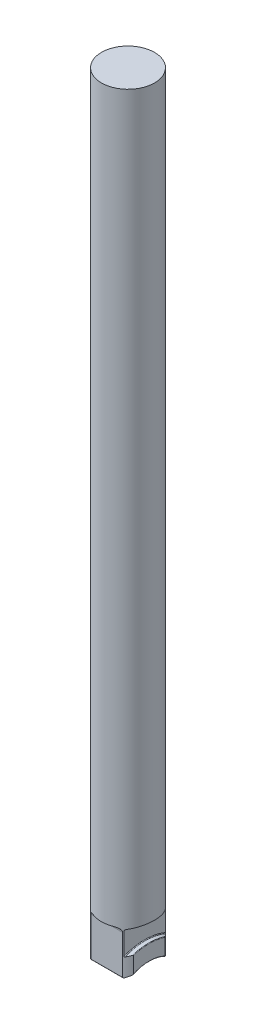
ISO-10303-21;
HEADER;
FILE_DESCRIPTION(('STEP AP214'),'2;1');
FILE_NAME('part.step','',(''),(''),'','','');
FILE_SCHEMA(('AUTOMOTIVE_DESIGN { 1 0 10303 214 1 1 1 1 }'));
ENDSEC;
DATA;
#1=APPLICATION_CONTEXT('core data for automotive mechanical design processes');
#2=APPLICATION_PROTOCOL_DEFINITION('international standard','automotive_design',2000,#1);
#3=PRODUCT_CONTEXT('',#1,'mechanical');
#4=PRODUCT('Part','Part','',(#3));
#5=PRODUCT_RELATED_PRODUCT_CATEGORY('part','',(#4));
#6=PRODUCT_DEFINITION_FORMATION('','',#4);
#7=PRODUCT_DEFINITION_CONTEXT('part definition',#1,'design');
#8=PRODUCT_DEFINITION('design','',#6,#7);
#9=PRODUCT_DEFINITION_SHAPE('','',#8);
#10=(LENGTH_UNIT() NAMED_UNIT(*) SI_UNIT(.MILLI.,.METRE.));
#11=(NAMED_UNIT(*) PLANE_ANGLE_UNIT() SI_UNIT($,.RADIAN.));
#12=(NAMED_UNIT(*) SI_UNIT($,.STERADIAN.) SOLID_ANGLE_UNIT());
#13=UNCERTAINTY_MEASURE_WITH_UNIT(LENGTH_MEASURE(1.E-05),#10,'distance_accuracy_value','');
#14=(GEOMETRIC_REPRESENTATION_CONTEXT(3) GLOBAL_UNCERTAINTY_ASSIGNED_CONTEXT((#13)) GLOBAL_UNIT_ASSIGNED_CONTEXT((#10,
#11,#12)) REPRESENTATION_CONTEXT('',''));
#15=CARTESIAN_POINT('',(0.,0.,0.));
#16=DIRECTION('',(0.,0.,1.));
#17=DIRECTION('',(1.,0.,0.));
#18=AXIS2_PLACEMENT_3D('',#15,#16,#17);
#19=CARTESIAN_POINT('',(-15.875,42.037,15.0876));
#20=DIRECTION('',(1.,0.,0.));
#21=DIRECTION('',(0.,0.,-1.));
#22=AXIS2_PLACEMENT_3D('',#19,#20,#21);
#23=CYLINDRICAL_SURFACE('',#22,2.3876);
#24=CARTESIAN_POINT('',(4.93760582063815,44.4246,15.0876));
#25=CARTESIAN_POINT('',(5.04970268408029,44.4245939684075,15.0509156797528));
#26=CARTESIAN_POINT('',(5.16139523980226,44.4237541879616,15.0129789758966));
#27=CARTESIAN_POINT('',(5.38390129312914,44.4200190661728,14.9346289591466));
#28=CARTESIAN_POINT('',(5.4947145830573,44.4171232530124,14.8942150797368));
#29=CARTESIAN_POINT('',(5.71585530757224,44.4088684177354,14.8107613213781));
#30=CARTESIAN_POINT('',(5.82617805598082,44.4034979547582,14.7677100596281));
#31=CARTESIAN_POINT('',(6.04566070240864,44.38984143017,14.6792243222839));
#32=CARTESIAN_POINT('',(6.15482068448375,44.381555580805,14.6337900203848));
#33=CARTESIAN_POINT('',(6.48273216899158,44.3513883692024,14.4929881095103));
#34=CARTESIAN_POINT('',(6.69954972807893,44.3242644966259,14.3940140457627));
#35=CARTESIAN_POINT('',(7.01911204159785,44.2695368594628,14.2394418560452));
#36=CARTESIAN_POINT('',(7.12459852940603,44.2489782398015,14.1869481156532));
#37=CARTESIAN_POINT('',(7.33341784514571,44.2024232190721,14.0801398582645));
#38=CARTESIAN_POINT('',(7.43675128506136,44.1764283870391,14.0258258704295));
#39=CARTESIAN_POINT('',(7.60695133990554,44.127821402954,13.9339843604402));
#40=CARTESIAN_POINT('',(7.67453827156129,44.1069500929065,13.8968685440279));
#41=CARTESIAN_POINT('',(7.80838112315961,44.0621085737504,13.8221088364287));
#42=CARTESIAN_POINT('',(7.87463694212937,44.0381381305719,13.7844649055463));
#43=CARTESIAN_POINT('',(8.07099595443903,43.9611532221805,13.6710431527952));
#44=CARTESIAN_POINT('',(8.19884576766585,43.9030225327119,13.5946914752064));
#45=CARTESIAN_POINT('',(8.44719970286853,43.7697302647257,13.4417963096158));
#46=CARTESIAN_POINT('',(8.56763123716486,43.6944265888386,13.3652568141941));
#47=CARTESIAN_POINT('',(8.79616961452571,43.5237422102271,13.2159568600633));
#48=CARTESIAN_POINT('',(8.90429664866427,43.4283951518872,13.143190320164));
#49=CARTESIAN_POINT('',(9.068409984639,43.2513453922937,13.0301916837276));
#50=CARTESIAN_POINT('',(9.12957674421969,43.176139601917,12.9873475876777));
#51=CARTESIAN_POINT('',(9.24164418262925,43.0154130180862,12.9078400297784));
#52=CARTESIAN_POINT('',(9.29255473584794,42.9299022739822,12.8711706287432));
#53=CARTESIAN_POINT('',(9.37446933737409,42.762998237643,12.8116013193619));
#54=CARTESIAN_POINT('',(9.40732558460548,42.6829679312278,12.7874540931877));
#55=CARTESIAN_POINT('',(9.46171992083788,42.5172759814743,12.7472599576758));
#56=CARTESIAN_POINT('',(9.48328155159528,42.431626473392,12.7311962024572));
#57=CARTESIAN_POINT('',(9.50722874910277,42.2938916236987,12.7133136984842));
#58=CARTESIAN_POINT('',(9.51386730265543,42.2429138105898,12.7083439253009));
#59=CARTESIAN_POINT('',(9.52276248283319,42.1403033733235,12.7016782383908));
#60=CARTESIAN_POINT('',(9.52501365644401,42.0886700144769,12.6999863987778));
#61=CARTESIAN_POINT('',(9.52499999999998,42.037,12.7));
#62=B_SPLINE_CURVE_WITH_KNOTS('',3,(#24,#25,#26,#27,#28,#29,#30,#31,#32,#33,#34,#35,#36,#37,#38,
#39,#40,#41,#42,#43,#44,#45,#46,#47,#48,#49,#50,#51,#52,#53,#54,#55,#56,#57,#58,#59,#60,#61),
.UNSPECIFIED.,.F.,.F.,(4,2,2,2,2,2,2,2,2,2,2,2,2,2,2,2,2,2,4),(0.,0.35383719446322,
0.707755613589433,1.06332695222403,1.41887240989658,2.13753657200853,2.49623834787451,
2.85483673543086,3.0944156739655,3.33401271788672,3.81266453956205,4.29543070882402,
4.77739289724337,5.09442025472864,5.41114091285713,5.67952941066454,5.94735624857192,
6.10203027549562,6.25689642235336),.UNSPECIFIED.);
#63=CARTESIAN_POINT('',(4.93760582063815,44.4246,15.0876));
#64=VERTEX_POINT('',#63);
#65=CARTESIAN_POINT('',(9.525,42.037,12.7));
#66=VERTEX_POINT('',#65);
#67=EDGE_CURVE('E386',#64,#66,#62,.T.);
#68=ORIENTED_EDGE('',*,*,#67,.F.);
#69=DIRECTION('',(1.,0.,0.));
#70=VECTOR('',#69,1.);
#71=CARTESIAN_POINT('',(-15.875,44.4246,15.0876));
#72=LINE('',#71,#70);
#73=CARTESIAN_POINT('',(-4.93760582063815,44.4246,15.0876));
#74=VERTEX_POINT('',#73);
#75=EDGE_CURVE('E565',#74,#64,#72,.T.);
#76=ORIENTED_EDGE('',*,*,#75,.F.);
#77=CARTESIAN_POINT('',(-9.52499999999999,42.037,12.7));
#78=CARTESIAN_POINT('',(-9.52501480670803,42.0848332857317,12.6999861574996));
#79=CARTESIAN_POINT('',(-9.52308398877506,42.1326552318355,12.701436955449));
#80=CARTESIAN_POINT('',(-9.51544592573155,42.2277804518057,12.707161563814));
#81=CARTESIAN_POINT('',(-9.50974239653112,42.2750841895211,12.7114325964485));
#82=CARTESIAN_POINT('',(-9.49475138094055,42.3682875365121,12.7226334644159));
#83=CARTESIAN_POINT('',(-9.48550163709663,42.4141966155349,12.729535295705));
#84=CARTESIAN_POINT('',(-9.46361835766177,42.5047444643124,12.7458126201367));
#85=CARTESIAN_POINT('',(-9.45098421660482,42.5493830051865,12.7551885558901));
#86=CARTESIAN_POINT('',(-9.40845479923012,42.6805861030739,12.7866274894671));
#87=CARTESIAN_POINT('',(-9.37385924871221,42.7648740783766,12.8120571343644));
#88=CARTESIAN_POINT('',(-9.29421478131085,42.9258376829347,12.8699504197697));
#89=CARTESIAN_POINT('',(-9.2491375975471,43.002491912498,12.9024330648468));
#90=CARTESIAN_POINT('',(-9.12802552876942,43.1808674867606,12.9885518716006));
#91=CARTESIAN_POINT('',(-9.04726879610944,43.2779849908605,13.0450616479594));
#92=CARTESIAN_POINT('',(-8.87309283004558,43.4556252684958,13.1641569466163));
#93=CARTESIAN_POINT('',(-8.77964900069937,43.5361150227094,13.2267542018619));
#94=CARTESIAN_POINT('',(-8.60248980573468,43.6683644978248,13.3424804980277));
#95=CARTESIAN_POINT('',(-8.52032634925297,43.7226752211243,13.3951337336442));
#96=CARTESIAN_POINT('',(-8.35134675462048,43.8227984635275,13.5011326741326));
#97=CARTESIAN_POINT('',(-8.26452763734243,43.8686054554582,13.5544788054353));
#98=CARTESIAN_POINT('',(-8.08711605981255,43.9527958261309,13.6610727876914));
#99=CARTESIAN_POINT('',(-7.99651760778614,43.9911668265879,13.7143203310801));
#100=CARTESIAN_POINT('',(-7.8123641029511,44.0613471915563,13.820053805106));
#101=CARTESIAN_POINT('',(-7.71880793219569,44.0931540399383,13.872539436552));
#102=CARTESIAN_POINT('',(-7.44466632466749,44.1769004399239,14.0226351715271));
#103=CARTESIAN_POINT('',(-7.26096196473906,44.2214578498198,14.1186917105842));
#104=CARTESIAN_POINT('',(-6.88735760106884,44.2947939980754,14.3046711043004));
#105=CARTESIAN_POINT('',(-6.69745172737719,44.3235572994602,14.394587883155));
#106=CARTESIAN_POINT('',(-6.31292485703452,44.3689357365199,14.5673285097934));
#107=CARTESIAN_POINT('',(-6.11830090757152,44.385543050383,14.6501477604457));
#108=CARTESIAN_POINT('',(-5.72552988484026,44.4095226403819,14.8080628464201));
#109=CARTESIAN_POINT('',(-5.52738461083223,44.4168995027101,14.8831625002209));
#110=CARTESIAN_POINT('',(-5.26298926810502,44.4221650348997,14.9773597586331));
#111=CARTESIAN_POINT('',(-5.19803762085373,44.4230969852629,15.000025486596));
#112=CARTESIAN_POINT('',(-5.06797257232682,44.4243138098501,15.0444670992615));
#113=CARTESIAN_POINT('',(-5.0028597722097,44.4246000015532,15.0662447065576));
#114=CARTESIAN_POINT('',(-4.93760582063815,44.4246,15.0876));
#115=B_SPLINE_CURVE_WITH_KNOTS('',3,(#77,#78,#79,#80,#81,#82,#83,#84,#85,#86,#87,#88,#89,#90,
#91,#92,#93,#94,#95,#96,#97,#98,#99,#100,#101,#102,#103,#104,#105,#106,#107,#108,#109,#110,#111,
#112,#113,#114),.UNSPECIFIED.,.F.,.F.,(4,2,2,2,2,2,2,2,2,2,2,2,2,2,2,2,2,2,4),(0.,
0.143420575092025,0.286700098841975,0.428495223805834,0.570315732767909,0.852639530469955,
1.13573371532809,1.54851814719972,1.96211456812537,2.29669621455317,2.63149457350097,
2.96684555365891,3.30232484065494,3.9373533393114,4.57300140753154,5.20905812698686,
5.84479869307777,6.05119065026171,6.25716114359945),.UNSPECIFIED.);
#116=CARTESIAN_POINT('',(-9.525,42.037,12.7));
#117=VERTEX_POINT('',#116);
#118=EDGE_CURVE('E67',#117,#74,#115,.T.);
#119=ORIENTED_EDGE('',*,*,#118,.F.);
#120=DIRECTION('',(1.,0.,0.));
#121=VECTOR('',#120,1.);
#122=CARTESIAN_POINT('',(-15.875,42.037,12.7));
#123=LINE('',#122,#121);
#124=EDGE_CURVE('E562',#117,#66,#123,.T.);
#125=ORIENTED_EDGE('',*,*,#124,.T.);
#126=EDGE_LOOP('',(#68,#76,#119,#125));
#127=FACE_BOUND('',#126,.T.);
#128=ADVANCED_FACE('F38',(#127),#23,.F.);
#129=CARTESIAN_POINT('',(-15.875,18.7190417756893,12.446));
#130=DIRECTION('',(1.,0.,0.));
#131=DIRECTION('',(0.,0.,-1.));
#132=AXIS2_PLACEMENT_3D('',#129,#130,#131);
#133=CYLINDRICAL_SURFACE('',#132,0.254);
#134=DIRECTION('',(1.,0.,0.));
#135=VECTOR('',#134,1.);
#136=CARTESIAN_POINT('',(-15.875,18.5075271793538,12.3053672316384));
#137=LINE('',#136,#135);
#138=CARTESIAN_POINT('',(10.0296342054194,18.5075271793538,12.3053672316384));
#139=VERTEX_POINT('',#138);
#140=CARTESIAN_POINT('',(-10.0296342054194,18.5075271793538,12.3053672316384));
#141=VERTEX_POINT('',#140);
#142=EDGE_CURVE('E224',#139,#141,#137,.F.);
#143=ORIENTED_EDGE('',*,*,#142,.F.);
#144=CARTESIAN_POINT('',(10.0296342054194,18.5075271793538,12.3053672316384));
#145=CARTESIAN_POINT('',(10.0188072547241,18.5016677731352,12.3141921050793));
#146=CARTESIAN_POINT('',(10.007763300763,18.4964855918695,12.3231695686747));
#147=CARTESIAN_POINT('',(9.9853550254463,18.487385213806,12.3413336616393));
#148=CARTESIAN_POINT('',(9.97399112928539,18.4834654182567,12.3505200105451));
#149=CARTESIAN_POINT('',(9.93960948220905,18.4734627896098,12.3782329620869));
#150=CARTESIAN_POINT('',(9.91624212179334,18.4691060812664,12.396962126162));
#151=CARTESIAN_POINT('',(9.86828632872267,18.4645166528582,12.4351730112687));
#152=CARTESIAN_POINT('',(9.8436851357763,18.4644461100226,12.4546564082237));
#153=CARTESIAN_POINT('',(9.79455690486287,18.4687318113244,12.4933284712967));
#154=CARTESIAN_POINT('',(9.77003002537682,18.4730944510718,12.5125166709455));
#155=CARTESIAN_POINT('',(9.72607298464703,18.485286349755,12.5467031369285));
#156=CARTESIAN_POINT('',(9.70652667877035,18.4923414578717,12.5618290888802));
#157=CARTESIAN_POINT('',(9.66838059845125,18.5099421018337,12.5912118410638));
#158=CARTESIAN_POINT('',(9.64977868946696,18.5204793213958,12.6054706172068));
#159=CARTESIAN_POINT('',(9.62104291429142,18.5408851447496,12.6274048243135));
#160=CARTESIAN_POINT('',(9.61036549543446,18.5495015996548,12.6355318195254));
#161=CARTESIAN_POINT('',(9.59004075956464,18.5685247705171,12.6509645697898));
#162=CARTESIAN_POINT('',(9.58039222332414,18.578929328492,12.6582712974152));
#163=CARTESIAN_POINT('',(9.56504258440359,18.5986629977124,12.6698718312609));
#164=CARTESIAN_POINT('',(9.55897535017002,18.6075375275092,12.6744491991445));
#165=CARTESIAN_POINT('',(9.54800933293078,18.6263675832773,12.6827122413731));
#166=CARTESIAN_POINT('',(9.54310892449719,18.6363215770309,12.6863991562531));
#167=CARTESIAN_POINT('',(9.53572716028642,18.6550126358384,12.6919482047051));
#168=CARTESIAN_POINT('',(9.53295410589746,18.6635678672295,12.6940308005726));
#169=CARTESIAN_POINT('',(9.52858439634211,18.6811264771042,12.6973112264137));
#170=CARTESIAN_POINT('',(9.52698496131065,18.6901287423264,12.6985111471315));
#171=CARTESIAN_POINT('',(9.52534361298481,18.7057992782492,12.6997422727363));
#172=CARTESIAN_POINT('',(9.52499190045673,18.7124189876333,12.7000059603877));
#173=CARTESIAN_POINT('',(9.525,18.7190417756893,12.7));
#174=B_SPLINE_CURVE_WITH_KNOTS('',3,(#144,#145,#146,#147,#148,#149,#150,#151,#152,#153,#154,
#155,#156,#157,#158,#159,#160,#161,#162,#163,#164,#165,#166,#167,#168,#169,#170,#171,#172,#173),
.UNSPECIFIED.,.F.,.F.,(4,2,2,2,2,2,2,2,2,2,2,2,2,2,4),(0.,0.0453949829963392,0.0907322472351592,
0.181161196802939,0.275009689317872,0.368993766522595,0.44589658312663,0.522617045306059,
0.57034468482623,0.618015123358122,0.652957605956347,0.687851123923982,0.715435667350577,
0.742954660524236,0.762806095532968),.UNSPECIFIED.);
#175=CARTESIAN_POINT('',(9.525,18.7190417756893,12.7));
#176=VERTEX_POINT('',#175);
#177=EDGE_CURVE('E370',#139,#176,#174,.T.);
#178=ORIENTED_EDGE('',*,*,#177,.T.);
#179=DIRECTION('',(1.,0.,0.));
#180=VECTOR('',#179,1.);
#181=CARTESIAN_POINT('',(-15.875,18.7190417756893,12.7));
#182=LINE('',#181,#180);
#183=CARTESIAN_POINT('',(-9.525,18.7190417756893,12.7));
#184=VERTEX_POINT('',#183);
#185=EDGE_CURVE('E242',#184,#176,#182,.T.);
#186=ORIENTED_EDGE('',*,*,#185,.F.);
#187=CARTESIAN_POINT('',(-9.525,18.7190417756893,12.7));
#188=CARTESIAN_POINT('',(-9.52497281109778,18.7085499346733,12.7000199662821));
#189=CARTESIAN_POINT('',(-9.52586494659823,18.6981017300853,12.699351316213));
#190=CARTESIAN_POINT('',(-9.52923677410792,18.6777422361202,12.6968215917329));
#191=CARTESIAN_POINT('',(-9.53169661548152,18.6678258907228,12.6949754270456));
#192=CARTESIAN_POINT('',(-9.53794881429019,18.6487486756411,12.6902786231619));
#193=CARTESIAN_POINT('',(-9.54173480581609,18.6395844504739,12.6874327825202));
#194=CARTESIAN_POINT('',(-9.55036434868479,18.6220490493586,12.680938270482));
#195=CARTESIAN_POINT('',(-9.55521147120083,18.6136806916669,12.6772868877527));
#196=CARTESIAN_POINT('',(-9.56864308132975,18.5933491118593,12.6671543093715));
#197=CARTESIAN_POINT('',(-9.57780301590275,18.5819882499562,12.6602315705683));
#198=CARTESIAN_POINT('',(-9.59738215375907,18.5611776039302,12.6453957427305));
#199=CARTESIAN_POINT('',(-9.60780389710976,18.5517317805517,12.6374806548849));
#200=CARTESIAN_POINT('',(-9.63588560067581,18.5294499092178,12.6160928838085));
#201=CARTESIAN_POINT('',(-9.65418001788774,18.5179143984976,12.6021026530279));
#202=CARTESIAN_POINT('',(-9.69187506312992,18.4984586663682,12.5731362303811));
#203=CARTESIAN_POINT('',(-9.71127854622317,18.4905482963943,12.5581574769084));
#204=CARTESIAN_POINT('',(-9.75855242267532,18.4754123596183,12.5214812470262));
#205=CARTESIAN_POINT('',(-9.78669907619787,18.4697322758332,12.4994973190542));
#206=CARTESIAN_POINT('',(-9.84313481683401,18.4642232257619,12.4551038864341));
#207=CARTESIAN_POINT('',(-9.87142367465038,18.4643867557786,12.4326949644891));
#208=CARTESIAN_POINT('',(-9.92183865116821,18.4700905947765,12.3924801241));
#209=CARTESIAN_POINT('',(-9.94406438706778,18.4745475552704,12.3746511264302));
#210=CARTESIAN_POINT('',(-9.97675369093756,18.4844010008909,12.3482876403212));
#211=CARTESIAN_POINT('',(-9.98754573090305,18.4882154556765,12.3395600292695));
#212=CARTESIAN_POINT('',(-10.0088361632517,18.4969901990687,12.3222973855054));
#213=CARTESIAN_POINT('',(-10.0193341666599,18.5019519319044,12.313762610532));
#214=CARTESIAN_POINT('',(-10.0296342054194,18.5075271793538,12.3053672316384));
#215=B_SPLINE_CURVE_WITH_KNOTS('',3,(#187,#188,#189,#190,#191,#192,#193,#194,#195,#196,#197,
#198,#199,#200,#201,#202,#203,#204,#205,#206,#207,#208,#209,#210,#211,#212,#213,#214),
.UNSPECIFIED.,.F.,.F.,(4,2,2,2,2,2,2,2,2,2,2,2,2,4),(0.,0.0313473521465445,0.062305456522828,
0.093116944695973,0.124033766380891,0.172216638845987,0.220498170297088,0.297344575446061,
0.374398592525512,0.482339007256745,0.590140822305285,0.676353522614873,0.719491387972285,
0.76268385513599),.UNSPECIFIED.);
#216=EDGE_CURVE('E507',#184,#141,#215,.T.);
#217=ORIENTED_EDGE('',*,*,#216,.T.);
#218=EDGE_LOOP('',(#143,#178,#186,#217));
#219=FACE_BOUND('',#218,.T.);
#220=ADVANCED_FACE('F514',(#219),#133,.T.);
#221=CARTESIAN_POINT('',(-15.875,0.,12.7));
#222=DIRECTION('',(0.,0.,-1.));
#223=DIRECTION('',(0.,1.,0.));
#224=AXIS2_PLACEMENT_3D('',#221,#222,#223);
#225=PLANE('',#224);
#226=DIRECTION('',(0.,1.,0.));
#227=VECTOR('',#226,1.);
#228=CARTESIAN_POINT('',(-9.525,18.4650417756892,12.7));
#229=LINE('',#228,#227);
#230=EDGE_CURVE('E513',#184,#117,#229,.T.);
#231=ORIENTED_EDGE('',*,*,#230,.F.);
#232=ORIENTED_EDGE('',*,*,#185,.T.);
#233=DIRECTION('',(0.,1.,0.));
#234=VECTOR('',#233,1.);
#235=CARTESIAN_POINT('',(9.525,18.4650417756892,12.7));
#236=LINE('',#235,#234);
#237=EDGE_CURVE('E661',#66,#176,#236,.F.);
#238=ORIENTED_EDGE('',*,*,#237,.F.);
#239=ORIENTED_EDGE('',*,*,#124,.F.);
#240=EDGE_LOOP('',(#231,#232,#238,#239));
#241=FACE_BOUND('',#240,.T.);
#242=ADVANCED_FACE('F517',(#241),#225,.F.);
#243=CARTESIAN_POINT('',(-15.875,44.4246,15.0876));
#244=DIRECTION('',(0.,1.,0.));
#245=DIRECTION('',(0.,0.,1.));
#246=AXIS2_PLACEMENT_3D('',#243,#244,#245);
#247=PLANE('',#246);
#248=ORIENTED_EDGE('',*,*,#75,.T.);
#249=CARTESIAN_POINT('',(0.,44.4246,0.));
#250=DIRECTION('',(0.,1.,0.));
#251=DIRECTION('',(0.,0.,1.));
#252=AXIS2_PLACEMENT_3D('',#249,#250,#251);
#253=CIRCLE('',#252,15.875);
#254=EDGE_CURVE('E554',#74,#64,#253,.T.);
#255=ORIENTED_EDGE('',*,*,#254,.F.);
#256=EDGE_LOOP('',(#248,#255));
#257=FACE_BOUND('',#256,.T.);
#258=ADVANCED_FACE('F543',(#257),#247,.F.);
#259=CARTESIAN_POINT('',(10.668,0.,0.));
#260=DIRECTION('',(1.,0.,0.));
#261=DIRECTION('',(0.,0.,-1.));
#262=AXIS2_PLACEMENT_3D('',#259,#260,#261);
#263=TOROIDAL_SURFACE('',#262,44.45,0.762);
#264=CARTESIAN_POINT('',(9.92051731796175,42.5331089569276,12.3935047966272));
#265=CARTESIAN_POINT('',(9.91309582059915,42.5701749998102,12.3994388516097));
#266=CARTESIAN_POINT('',(9.90862888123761,42.6080607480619,12.4030102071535));
#267=CARTESIAN_POINT('',(9.90512959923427,42.6839329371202,12.4058082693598));
#268=CARTESIAN_POINT('',(9.90605058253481,42.7219156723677,12.4050722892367));
#269=CARTESIAN_POINT('',(9.91272750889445,42.7969689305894,12.3997364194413));
#270=CARTESIAN_POINT('',(9.91846324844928,42.8340426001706,12.3951526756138));
#271=CARTESIAN_POINT('',(9.93409291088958,42.9067807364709,12.3826299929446));
#272=CARTESIAN_POINT('',(9.94399724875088,42.9424414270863,12.3746826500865));
#273=CARTESIAN_POINT('',(9.97237133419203,43.0267348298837,12.3518375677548));
#274=CARTESIAN_POINT('',(9.99269293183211,43.0743352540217,12.3354205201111));
#275=CARTESIAN_POINT('',(10.0389252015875,43.1646675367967,12.2978247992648));
#276=CARTESIAN_POINT('',(10.0648440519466,43.2073921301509,12.2766391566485));
#277=CARTESIAN_POINT('',(10.1289255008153,43.2989643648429,12.2238562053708));
#278=CARTESIAN_POINT('',(10.1684767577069,43.346119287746,12.1910094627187));
#279=CARTESIAN_POINT('',(10.2525425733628,43.4314538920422,12.1203966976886));
#280=CARTESIAN_POINT('',(10.2970628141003,43.4696231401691,12.0826250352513));
#281=CARTESIAN_POINT('',(10.39014895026,43.5372540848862,12.0026769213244));
#282=CARTESIAN_POINT('',(10.4387648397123,43.5665790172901,11.9604437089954));
#283=CARTESIAN_POINT('',(10.5380656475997,43.615431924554,11.8730428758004));
#284=CARTESIAN_POINT('',(10.5887464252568,43.6349785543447,11.8278810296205));
#285=CARTESIAN_POINT('',(10.6643064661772,43.6562774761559,11.7596471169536));
#286=CARTESIAN_POINT('',(10.6888275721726,43.6619906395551,11.7373656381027));
#287=CARTESIAN_POINT('',(10.7133875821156,43.6665049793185,11.7149029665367));
#288=B_SPLINE_CURVE_WITH_KNOTS('',3,(#264,#265,#266,#267,#268,#269,#270,#271,#272,#273,#274,
#275,#276,#277,#278,#279,#280,#281,#282,#283,#284,#285,#286,#287),.UNSPECIFIED.,.F.,.F.,(4,2,2,
2,2,2,2,2,2,2,2,4),(0.,0.114394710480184,0.227799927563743,0.340731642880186,0.45394720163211,
0.615951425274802,0.778193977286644,0.986385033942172,1.19481664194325,1.40632311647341,
1.61742452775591,1.71819996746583),.UNSPECIFIED.);
#289=CARTESIAN_POINT('',(9.906,42.6839045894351,12.4051114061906));
#290=VERTEX_POINT('',#289);
#291=CARTESIAN_POINT('',(10.668,43.6567926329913,11.7562494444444));
#292=VERTEX_POINT('',#291);
#293=EDGE_CURVE('E378',#290,#292,#288,.T.);
#294=ORIENTED_EDGE('',*,*,#293,.F.);
#295=CARTESIAN_POINT('',(9.906,0.,0.));
#296=DIRECTION('',(1.,0.,0.));
#297=DIRECTION('',(0.,0.,-1.));
#298=AXIS2_PLACEMENT_3D('',#295,#296,#297);
#299=CIRCLE('',#298,44.45);
#300=CARTESIAN_POINT('',(9.906,42.6839045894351,-12.4051114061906));
#301=VERTEX_POINT('',#300);
#302=EDGE_CURVE('E576',#301,#290,#299,.T.);
#303=ORIENTED_EDGE('',*,*,#302,.F.);
#304=CARTESIAN_POINT('',(10.7133875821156,43.6665049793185,-11.7149029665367));
#305=CARTESIAN_POINT('',(10.6842958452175,43.6611558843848,-11.741508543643));
#306=CARTESIAN_POINT('',(10.6552900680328,43.6541342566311,-11.767834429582));
#307=CARTESIAN_POINT('',(10.5976238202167,43.6368373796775,-11.8197926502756));
#308=CARTESIAN_POINT('',(10.5689633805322,43.6265618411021,-11.845424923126));
#309=CARTESIAN_POINT('',(10.4833680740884,43.5908264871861,-11.9214280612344));
#310=CARTESIAN_POINT('',(10.4272339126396,43.5605355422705,-11.9705266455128));
#311=CARTESIAN_POINT('',(10.3191153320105,43.4877096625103,-12.0638548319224));
#312=CARTESIAN_POINT('',(10.2671280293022,43.4451833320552,-12.1080878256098));
#313=CARTESIAN_POINT('',(10.1696814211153,43.3482527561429,-12.1900462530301));
#314=CARTESIAN_POINT('',(10.1241987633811,43.2938928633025,-12.2277950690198));
#315=CARTESIAN_POINT('',(10.0570782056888,43.1948414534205,-12.2829960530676));
#316=CARTESIAN_POINT('',(10.0326591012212,43.1533995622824,-12.3029333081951));
#317=CARTESIAN_POINT('',(9.98906937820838,43.0660374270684,-12.338350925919));
#318=CARTESIAN_POINT('',(9.96989418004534,43.0201211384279,-12.3538351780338));
#319=CARTESIAN_POINT('',(9.94151532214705,42.9344057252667,-12.3766781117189));
#320=CARTESIAN_POINT('',(9.93107204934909,42.8952900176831,-12.3850528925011));
#321=CARTESIAN_POINT('',(9.9152765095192,42.8154641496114,-12.3977021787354));
#322=CARTESIAN_POINT('',(9.90990943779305,42.7747589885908,-12.4019886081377));
#323=CARTESIAN_POINT('',(9.90550349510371,42.7002573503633,-12.4055083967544));
#324=CARTESIAN_POINT('',(9.90548689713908,42.6665586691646,-12.4055224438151));
#325=CARTESIAN_POINT('',(9.90970086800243,42.5993892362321,-12.4021544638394));
#326=CARTESIAN_POINT('',(9.9139593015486,42.5659214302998,-12.3987501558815));
#327=CARTESIAN_POINT('',(9.92051731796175,42.5331089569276,-12.3935047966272));
#328=B_SPLINE_CURVE_WITH_KNOTS('',3,(#304,#305,#306,#307,#308,#309,#310,#311,#312,#313,#314,
#315,#316,#317,#318,#319,#320,#321,#322,#323,#324,#325,#326,#327),.UNSPECIFIED.,.F.,.F.,(4,2,2,
2,2,2,2,2,2,2,2,4),(0.,0.119269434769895,0.238549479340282,0.478789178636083,0.718860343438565,
0.958046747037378,1.11373341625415,1.26928368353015,1.39285084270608,1.51605649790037,
1.61673233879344,1.71806867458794),.UNSPECIFIED.);
#329=CARTESIAN_POINT('',(10.668,43.6567926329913,-11.7562494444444));
#330=VERTEX_POINT('',#329);
#331=EDGE_CURVE('E314',#330,#301,#328,.T.);
#332=ORIENTED_EDGE('',*,*,#331,.F.);
#333=CARTESIAN_POINT('',(10.668,0.,0.));
#334=DIRECTION('',(1.,0.,0.));
#335=DIRECTION('',(0.,0.,-1.));
#336=AXIS2_PLACEMENT_3D('',#333,#334,#335);
#337=CIRCLE('',#336,45.212);
#338=EDGE_CURVE('E573',#292,#330,#337,.F.);
#339=ORIENTED_EDGE('',*,*,#338,.F.);
#340=EDGE_LOOP('',(#294,#303,#332,#339));
#341=FACE_BOUND('',#340,.T.);
#342=ADVANCED_FACE('F652',(#341),#263,.F.);
#343=CARTESIAN_POINT('',(-8.84822894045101,0.,0.));
#344=DIRECTION('',(-1.,0.,0.));
#345=DIRECTION('',(0.,0.,1.));
#346=AXIS2_PLACEMENT_3D('',#343,#344,#345);
#347=CYLINDRICAL_SURFACE('',#346,45.212);
#348=ORIENTED_EDGE('',*,*,#338,.T.);
#349=CARTESIAN_POINT('',(10.668,43.6567926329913,-11.7562494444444));
#350=CARTESIAN_POINT('',(10.9968267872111,43.7371520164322,-11.4578941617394));
#351=CARTESIAN_POINT('',(11.3130533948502,43.8179127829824,-11.1457544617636));
#352=CARTESIAN_POINT('',(11.9184518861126,43.9781014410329,-10.495864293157));
#353=CARTESIAN_POINT('',(12.2076202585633,44.0575291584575,-10.1581105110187));
#354=CARTESIAN_POINT('',(12.7573869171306,44.2130143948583,-9.45848749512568));
#355=CARTESIAN_POINT('',(13.0179402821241,44.2890665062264,-9.09658173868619));
#356=CARTESIAN_POINT('',(13.5081240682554,44.4356164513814,-8.35135252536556));
#357=CARTESIAN_POINT('',(13.7377561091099,44.5061145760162,-7.96803019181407));
#358=CARTESIAN_POINT('',(14.1646981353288,44.6397447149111,-7.18174035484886));
#359=CARTESIAN_POINT('',(14.3619563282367,44.7028648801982,-6.77874268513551));
#360=CARTESIAN_POINT('',(14.7220642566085,44.8198558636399,-5.95633668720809));
#361=CARTESIAN_POINT('',(14.88491334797,44.8737265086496,-5.53692805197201));
#362=CARTESIAN_POINT('',(15.1745757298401,44.9706398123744,-4.68508821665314));
#363=CARTESIAN_POINT('',(15.3014247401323,45.0136931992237,-4.25267039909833));
#364=CARTESIAN_POINT('',(15.5180628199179,45.0877945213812,-3.37764326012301));
#365=CARTESIAN_POINT('',(15.6078535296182,45.1188429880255,-2.93503439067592));
#366=CARTESIAN_POINT('',(15.7468636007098,45.1671224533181,-2.05941112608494));
#367=CARTESIAN_POINT('',(15.797447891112,45.1848176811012,-1.62663867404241));
#368=CARTESIAN_POINT('',(15.86286880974,45.2077314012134,-0.758072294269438));
#369=CARTESIAN_POINT('',(15.8777062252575,45.212950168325,-0.322278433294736));
#370=CARTESIAN_POINT('',(15.8714845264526,45.2107656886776,0.548964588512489));
#371=CARTESIAN_POINT('',(15.8504298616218,45.2033640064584,0.984413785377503));
#372=CARTESIAN_POINT('',(15.7726450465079,45.1761477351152,1.85171621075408));
#373=CARTESIAN_POINT('',(15.7159153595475,45.1563333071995,2.2835694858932));
#374=CARTESIAN_POINT('',(15.5696980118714,45.1056568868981,3.12689113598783));
#375=CARTESIAN_POINT('',(15.4813039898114,45.0751644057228,3.5385720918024));
#376=CARTESIAN_POINT('',(15.2723843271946,45.003837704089,4.35276207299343));
#377=CARTESIAN_POINT('',(15.1518596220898,44.9630037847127,4.75527136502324));
#378=CARTESIAN_POINT('',(14.8795890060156,44.8719848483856,5.54883429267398));
#379=CARTESIAN_POINT('',(14.7278194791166,44.8217927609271,5.93987900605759));
#380=CARTESIAN_POINT('',(14.3943076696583,44.7133152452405,6.70781684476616));
#381=CARTESIAN_POINT('',(14.2125632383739,44.6550292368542,7.08470895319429));
#382=CARTESIAN_POINT('',(13.8012705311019,44.5257524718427,7.85815806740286));
#383=CARTESIAN_POINT('',(13.568787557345,44.4540769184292,8.25304288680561));
#384=CARTESIAN_POINT('',(13.0711569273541,44.3047193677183,9.02051661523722));
#385=CARTESIAN_POINT('',(12.806004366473,44.2270364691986,9.39310216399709));
#386=CARTESIAN_POINT('',(12.2451705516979,44.067916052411,10.1133361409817));
#387=CARTESIAN_POINT('',(11.9495059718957,43.9864805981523,10.4609980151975));
#388=CARTESIAN_POINT('',(11.3296468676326,43.8221535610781,11.1293596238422));
#389=CARTESIAN_POINT('',(11.0054588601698,43.7392623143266,11.4500654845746));
#390=CARTESIAN_POINT('',(10.668,43.6567926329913,11.7562494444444));
#391=B_SPLINE_CURVE_WITH_KNOTS('',3,(#349,#350,#351,#352,#353,#354,#355,#356,#357,#358,#359,
#360,#361,#362,#363,#364,#365,#366,#367,#368,#369,#370,#371,#372,#373,#374,#375,#376,#377,#378,
#379,#380,#381,#382,#383,#384,#385,#386,#387,#388,#389,#390),.UNSPECIFIED.,.F.,.F.,(4,2,2,2,2,2,
2,2,2,2,2,2,2,2,2,2,2,2,2,2,4),(0.,1.35328805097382,2.70675146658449,4.06231012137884,
5.41779774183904,6.77543319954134,8.13309406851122,9.48940309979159,10.8456520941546,
12.1522504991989,13.458820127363,14.7652277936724,16.0716184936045,17.3366611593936,
18.601666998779,19.8676325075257,21.1336888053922,22.5233426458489,23.9132053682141,
25.3023125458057,26.6911031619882),.UNSPECIFIED.);
#392=EDGE_CURVE('E323',#330,#292,#391,.T.);
#393=ORIENTED_EDGE('',*,*,#392,.T.);
#394=EDGE_LOOP('',(#348,#393));
#395=FACE_BOUND('',#394,.T.);
#396=ADVANCED_FACE('F545',(#395),#347,.F.);
#397=CARTESIAN_POINT('',(10.287,0.,0.));
#398=DIRECTION('',(1.,0.,0.));
#399=DIRECTION('',(0.,0.,-1.));
#400=AXIS2_PLACEMENT_3D('',#397,#398,#399);
#401=TOROIDAL_SURFACE('',#400,32.131,0.381);
#402=CARTESIAN_POINT('',(10.3139238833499,29.3680844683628,12.0680818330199));
#403=CARTESIAN_POINT('',(10.2908184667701,29.3582318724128,12.0878333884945));
#404=CARTESIAN_POINT('',(10.2670244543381,29.3503437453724,12.1080496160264));
#405=CARTESIAN_POINT('',(10.2183955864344,29.3394852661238,12.1491156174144));
#406=CARTESIAN_POINT('',(10.1935517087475,29.3365746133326,12.1699700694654));
#407=CARTESIAN_POINT('',(10.1516930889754,29.3368866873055,12.2048861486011));
#408=CARTESIAN_POINT('',(10.1347116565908,29.3384476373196,12.2189903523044));
#409=CARTESIAN_POINT('',(10.1011109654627,29.3448950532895,12.2467813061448));
#410=CARTESIAN_POINT('',(10.0844905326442,29.3497682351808,12.2604694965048));
#411=CARTESIAN_POINT('',(10.0551519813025,29.3619976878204,12.2845363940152));
#412=CARTESIAN_POINT('',(10.0422860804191,29.3687178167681,12.2950547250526));
#413=CARTESIAN_POINT('',(10.0175385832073,29.3848016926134,12.3152263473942));
#414=CARTESIAN_POINT('',(10.005656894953,29.3941651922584,12.3248797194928));
#415=CARTESIAN_POINT('',(9.98329394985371,29.4156155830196,12.3430011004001));
#416=CARTESIAN_POINT('',(9.97282432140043,29.4277231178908,12.3514592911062));
#417=CARTESIAN_POINT('',(9.95391582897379,29.4543372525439,12.3667025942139));
#418=CARTESIAN_POINT('',(9.94547543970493,29.468842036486,12.3734889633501));
#419=CARTESIAN_POINT('',(9.93193186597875,29.4976752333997,12.3843619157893));
#420=CARTESIAN_POINT('',(9.92653693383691,29.5117796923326,12.3886852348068));
#421=CARTESIAN_POINT('',(9.9176393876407,29.5409329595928,12.3958092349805));
#422=CARTESIAN_POINT('',(9.91413691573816,29.5559818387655,12.3986098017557));
#423=CARTESIAN_POINT('',(9.90894109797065,29.5868489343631,12.4027627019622));
#424=CARTESIAN_POINT('',(9.90728045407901,29.6026760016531,12.404088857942));
#425=CARTESIAN_POINT('',(9.90573747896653,29.6344652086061,12.405321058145));
#426=CARTESIAN_POINT('',(9.90585609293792,29.650427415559,12.4052263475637));
#427=CARTESIAN_POINT('',(9.90813247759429,29.6898238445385,12.4034083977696));
#428=CARTESIAN_POINT('',(9.91124100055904,29.7131698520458,12.4009258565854));
#429=CARTESIAN_POINT('',(9.92035151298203,29.7589168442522,12.393638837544));
#430=CARTESIAN_POINT('',(9.92635971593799,29.7813156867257,12.38882937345));
#431=CARTESIAN_POINT('',(9.94325901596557,29.8324154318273,12.3752729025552));
#432=CARTESIAN_POINT('',(9.95512265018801,29.860584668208,12.3657373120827));
#433=CARTESIAN_POINT('',(9.98216267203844,29.9141155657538,12.3439197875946));
#434=CARTESIAN_POINT('',(9.99734397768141,29.9394729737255,12.3316337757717));
#435=CARTESIAN_POINT('',(10.0344831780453,29.9931872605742,12.3014421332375));
#436=CARTESIAN_POINT('',(10.0571833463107,30.0206749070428,12.2829014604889));
#437=CARTESIAN_POINT('',(10.1056223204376,30.0704616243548,12.2430800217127));
#438=CARTESIAN_POINT('',(10.1313617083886,30.0927596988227,12.2217987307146));
#439=CARTESIAN_POINT('',(10.1826762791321,30.1299576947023,12.1790695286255));
#440=CARTESIAN_POINT('',(10.2080556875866,30.1453443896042,12.1578108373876));
#441=CARTESIAN_POINT('',(10.2601279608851,30.1708602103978,12.113900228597));
#442=CARTESIAN_POINT('',(10.2868187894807,30.1809972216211,12.0912504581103));
#443=CARTESIAN_POINT('',(10.313923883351,30.18823629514,12.0680818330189));
#444=B_SPLINE_CURVE_WITH_KNOTS('',3,(#402,#403,#404,#405,#406,#407,#408,#409,#410,#411,#412,
#413,#414,#415,#416,#417,#418,#419,#420,#421,#422,#423,#424,#425,#426,#427,#428,#429,#430,#431,
#432,#433,#434,#435,#436,#437,#438,#439,#440,#441,#442,#443),.UNSPECIFIED.,.F.,.F.,(4,2,2,2,2,2,
2,2,2,2,2,2,2,2,2,2,2,2,2,2,4),(0.,0.0960829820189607,0.193310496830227,0.25949015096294,
0.325405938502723,0.37897414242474,0.432537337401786,0.486517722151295,0.540457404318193,
0.58735869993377,0.634263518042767,0.681988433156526,0.729738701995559,0.800391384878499,
0.871196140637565,0.966733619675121,1.06241369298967,1.18234938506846,1.30230808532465,
1.41141525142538,1.52035805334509),.UNSPECIFIED.);
#445=CARTESIAN_POINT('',(10.287,29.3576096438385,12.0910403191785));
#446=VERTEX_POINT('',#445);
#447=CARTESIAN_POINT('',(9.90599999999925,29.6397431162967,12.4051114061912));
#448=VERTEX_POINT('',#447);
#449=EDGE_CURVE('E355',#446,#448,#444,.T.);
#450=ORIENTED_EDGE('',*,*,#449,.F.);
#451=CARTESIAN_POINT('',(10.287,0.,0.));
#452=DIRECTION('',(1.,0.,0.));
#453=DIRECTION('',(0.,0.,-1.));
#454=AXIS2_PLACEMENT_3D('',#451,#452,#453);
#455=CIRCLE('',#454,31.75);
#456=CARTESIAN_POINT('',(10.287,29.3576096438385,-12.0910403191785));
#457=VERTEX_POINT('',#456);
#458=EDGE_CURVE('E227',#457,#446,#455,.T.);
#459=ORIENTED_EDGE('',*,*,#458,.F.);
#460=CARTESIAN_POINT('',(10.313923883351,30.18823629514,-12.0680818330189));
#461=CARTESIAN_POINT('',(10.2992347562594,30.1843331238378,-12.0806360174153));
#462=CARTESIAN_POINT('',(10.2846684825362,30.1795616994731,-12.0930383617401));
#463=CARTESIAN_POINT('',(10.2558656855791,30.1683960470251,-12.1174749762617));
#464=CARTESIAN_POINT('',(10.2416289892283,30.1620026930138,-12.1295094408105));
#465=CARTESIAN_POINT('',(10.1994852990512,30.1405368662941,-12.1650101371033));
#466=CARTESIAN_POINT('',(10.1721767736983,30.1231875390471,-12.1878462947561));
#467=CARTESIAN_POINT('',(10.1196810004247,30.0829360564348,-12.2314699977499));
#468=CARTESIAN_POINT('',(10.0945122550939,30.0599910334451,-12.252239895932));
#469=CARTESIAN_POINT('',(10.0473066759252,30.0090415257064,-12.2909797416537));
#470=CARTESIAN_POINT('',(10.0252678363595,29.9810403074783,-12.3089514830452));
#471=CARTESIAN_POINT('',(9.98996948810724,29.9273433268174,-12.3376062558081));
#472=CARTESIAN_POINT('',(9.97585602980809,29.9025942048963,-12.3490153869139));
#473=CARTESIAN_POINT('',(9.95079396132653,29.850549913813,-12.3692191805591));
#474=CARTESIAN_POINT('',(9.93984027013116,29.8232589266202,-12.3780180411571));
#475=CARTESIAN_POINT('',(9.92431035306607,29.7738973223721,-12.3904705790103));
#476=CARTESIAN_POINT('',(9.9188173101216,29.752303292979,-12.3948664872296));
#477=CARTESIAN_POINT('',(9.91054600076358,29.7082683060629,-12.4014810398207));
#478=CARTESIAN_POINT('',(9.90776409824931,29.6858285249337,-12.4037026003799));
#479=CARTESIAN_POINT('',(9.90569037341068,29.6453628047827,-12.4053586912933));
#480=CARTESIAN_POINT('',(9.90579314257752,29.6273892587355,-12.4052766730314));
#481=CARTESIAN_POINT('',(9.90829389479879,29.5916949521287,-12.4032794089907));
#482=CARTESIAN_POINT('',(9.91069051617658,29.5739740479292,-12.4013652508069));
#483=CARTESIAN_POINT('',(9.91797951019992,29.5392253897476,-12.3955366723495));
#484=CARTESIAN_POINT('',(9.92289164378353,29.5222042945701,-12.3916064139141));
#485=CARTESIAN_POINT('',(9.93520834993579,29.4897194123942,-12.381733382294));
#486=CARTESIAN_POINT('',(9.94261098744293,29.4742544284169,-12.3757921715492));
#487=CARTESIAN_POINT('',(9.95853494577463,29.4473757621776,-12.3629808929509));
#488=CARTESIAN_POINT('',(9.9667885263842,29.4356968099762,-12.3563297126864));
#489=CARTESIAN_POINT('',(9.98467909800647,29.4142750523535,-12.3418775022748));
#490=CARTESIAN_POINT('',(9.99431629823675,29.4045325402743,-12.3340762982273));
#491=CARTESIAN_POINT('',(10.0147108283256,29.3870287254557,-12.3175227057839));
#492=CARTESIAN_POINT('',(10.0254770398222,29.3792850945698,-12.3087627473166));
#493=CARTESIAN_POINT('',(10.04771841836,29.3658574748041,-12.2906137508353));
#494=CARTESIAN_POINT('',(10.0591935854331,29.3601734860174,-12.2812247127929));
#495=CARTESIAN_POINT('',(10.0884786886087,29.3483592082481,-12.2571912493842));
#496=CARTESIAN_POINT('',(10.1065659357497,29.3434483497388,-12.2422835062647));
#497=CARTESIAN_POINT('',(10.1431005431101,29.3374294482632,-12.2120311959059));
#498=CARTESIAN_POINT('',(10.1615492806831,29.3363411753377,-12.1966847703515));
#499=CARTESIAN_POINT('',(10.2029370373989,29.3375749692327,-12.1620966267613));
#500=CARTESIAN_POINT('',(10.225835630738,29.3408258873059,-12.1428481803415));
#501=CARTESIAN_POINT('',(10.2706459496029,29.3515527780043,-12.1049711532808));
#502=CARTESIAN_POINT('',(10.2925666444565,29.35897316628,-12.0863377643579));
#503=CARTESIAN_POINT('',(10.3139238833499,29.3680844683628,-12.0680818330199));
#504=B_SPLINE_CURVE_WITH_KNOTS('',3,(#460,#461,#462,#463,#464,#465,#466,#467,#468,#469,#470,
#471,#472,#473,#474,#475,#476,#477,#478,#479,#480,#481,#482,#483,#484,#485,#486,#487,#488,#489,
#490,#491,#492,#493,#494,#495,#496,#497,#498,#499,#500,#501,#502,#503),.UNSPECIFIED.,.F.,.F.,(4,
2,2,2,2,2,2,2,2,2,2,2,2,2,2,2,2,2,2,2,2,4),(0.,0.0590913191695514,0.1181508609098,
0.236397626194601,0.355580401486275,0.474686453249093,0.566447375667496,0.658059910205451,
0.725965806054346,0.793780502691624,0.847494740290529,0.901177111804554,0.955287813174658,
1.00935656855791,1.05644612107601,1.10354280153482,1.15104260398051,1.19854240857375,
1.26998698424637,1.34180052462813,1.43171717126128,1.52046262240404),.UNSPECIFIED.);
#505=CARTESIAN_POINT('',(9.90599999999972,29.6397431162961,-12.4051114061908));
#506=VERTEX_POINT('',#505);
#507=EDGE_CURVE('E290',#506,#457,#504,.T.);
#508=ORIENTED_EDGE('',*,*,#507,.F.);
#509=CARTESIAN_POINT('',(9.906,0.,0.));
#510=DIRECTION('',(1.,0.,0.));
#511=DIRECTION('',(0.,0.,-1.));
#512=AXIS2_PLACEMENT_3D('',#509,#510,#511);
#513=CIRCLE('',#512,32.131);
#514=EDGE_CURVE('E585',#448,#506,#513,.F.);
#515=ORIENTED_EDGE('',*,*,#514,.F.);
#516=EDGE_LOOP('',(#450,#459,#508,#515));
#517=FACE_BOUND('',#516,.T.);
#518=ADVANCED_FACE('F595',(#517),#401,.F.);
#519=CARTESIAN_POINT('',(12.446,0.,0.));
#520=DIRECTION('',(-1.,0.,0.));
#521=DIRECTION('',(0.,0.,1.));
#522=AXIS2_PLACEMENT_3D('',#519,#520,#521);
#523=TOROIDAL_SURFACE('',#522,31.496,0.254);
#524=CARTESIAN_POINT('',(12.446,0.,0.));
#525=DIRECTION('',(-1.,0.,0.));
#526=DIRECTION('',(0.,0.,1.));
#527=AXIS2_PLACEMENT_3D('',#524,#525,#526);
#528=CIRCLE('',#527,31.75);
#529=CARTESIAN_POINT('',(12.446,30.1819447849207,9.85457807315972));
#530=VERTEX_POINT('',#529);
#531=CARTESIAN_POINT('',(12.446,30.1819447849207,-9.8545780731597));
#532=VERTEX_POINT('',#531);
#533=EDGE_CURVE('E245',#530,#532,#528,.T.);
#534=ORIENTED_EDGE('',*,*,#533,.F.);
#535=CARTESIAN_POINT('',(12.4279147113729,30.1738131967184,9.87737621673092));
#536=CARTESIAN_POINT('',(12.4388151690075,30.1791131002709,9.86366143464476));
#537=CARTESIAN_POINT('',(12.4498248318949,30.1837429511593,9.8497618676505));
#538=CARTESIAN_POINT('',(12.4720398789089,30.191543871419,9.82161732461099));
#539=CARTESIAN_POINT('',(12.4832458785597,30.1947089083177,9.80737117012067));
#540=CARTESIAN_POINT('',(12.5058449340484,30.1994378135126,9.77853806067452));
#541=CARTESIAN_POINT('',(12.5172387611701,30.2009865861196,9.7639491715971));
#542=CARTESIAN_POINT('',(12.5399977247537,30.2022011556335,9.73470205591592));
#543=CARTESIAN_POINT('',(12.5513628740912,30.2018705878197,9.72004401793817));
#544=CARTESIAN_POINT('',(12.5720071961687,30.1992469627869,9.69332215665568));
#545=CARTESIAN_POINT('',(12.581310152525,30.1972998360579,9.68124413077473));
#546=CARTESIAN_POINT('',(12.5996880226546,30.1916144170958,9.65731400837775));
#547=CARTESIAN_POINT('',(12.6087628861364,30.1878757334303,9.64546196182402));
#548=CARTESIAN_POINT('',(12.626597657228,30.1781764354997,9.6221034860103));
#549=CARTESIAN_POINT('',(12.6353507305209,30.1721830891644,9.61060498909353));
#550=CARTESIAN_POINT('',(12.6519663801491,30.1575282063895,9.58872034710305));
#551=CARTESIAN_POINT('',(12.6598330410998,30.1488796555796,9.57832911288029));
#552=CARTESIAN_POINT('',(12.6709682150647,30.1329686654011,9.56358906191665));
#553=CARTESIAN_POINT('',(12.6747616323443,30.1267030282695,9.55856034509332));
#554=CARTESIAN_POINT('',(12.6816819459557,30.1132291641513,9.54937698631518));
#555=CARTESIAN_POINT('',(12.6848094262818,30.1060217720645,9.54522157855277));
#556=CARTESIAN_POINT('',(12.6902603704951,30.0907506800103,9.53797345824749));
#557=CARTESIAN_POINT('',(12.6925791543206,30.0826823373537,9.53488693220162));
#558=CARTESIAN_POINT('',(12.6962872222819,30.065974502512,9.5299488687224));
#559=CARTESIAN_POINT('',(12.6976765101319,30.0573350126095,9.52809732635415));
#560=CARTESIAN_POINT('',(12.6994526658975,30.0404310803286,9.52572983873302));
#561=CARTESIAN_POINT('',(12.6999051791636,30.0321851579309,9.52512643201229));
#562=CARTESIAN_POINT('',(12.7000680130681,30.0156767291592,9.5249093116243));
#563=CARTESIAN_POINT('',(12.6997779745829,30.0074142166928,9.52529607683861));
#564=CARTESIAN_POINT('',(12.6982466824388,29.9870318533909,9.52733743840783));
#565=CARTESIAN_POINT('',(12.6966106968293,29.974994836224,9.52951811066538));
#566=CARTESIAN_POINT('',(12.6922174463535,29.9515030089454,9.53536860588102));
#567=CARTESIAN_POINT('',(12.6894573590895,29.9400497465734,9.53904217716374));
#568=CARTESIAN_POINT('',(12.6812102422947,29.9113015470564,9.55000532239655));
#569=CARTESIAN_POINT('',(12.6750735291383,29.8945238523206,9.55815170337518));
#570=CARTESIAN_POINT('',(12.6613509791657,29.862681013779,9.57632224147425));
#571=CARTESIAN_POINT('',(12.6537615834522,29.8476202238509,9.58635100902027));
#572=CARTESIAN_POINT('',(12.6319860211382,29.8092944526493,9.6150434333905));
#573=CARTESIAN_POINT('',(12.6168431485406,29.7874795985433,9.63491496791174));
#574=CARTESIAN_POINT('',(12.5846383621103,29.7478403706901,9.67694226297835));
#575=CARTESIAN_POINT('',(12.567571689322,29.7300262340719,9.69910367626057));
#576=CARTESIAN_POINT('',(12.5307678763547,29.6971461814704,9.74661191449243));
#577=CARTESIAN_POINT('',(12.5109274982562,29.6823586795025,9.77207310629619));
#578=CARTESIAN_POINT('',(12.4803299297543,29.6637489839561,9.81107851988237));
#579=CARTESIAN_POINT('',(12.4700328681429,29.6581559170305,9.82416350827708));
#580=CARTESIAN_POINT('',(12.4491684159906,29.6482132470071,9.85058953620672));
#581=CARTESIAN_POINT('',(12.4386009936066,29.6438637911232,9.86393060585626));
#582=CARTESIAN_POINT('',(12.4279147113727,29.6401802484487,9.87737621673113));
#583=B_SPLINE_CURVE_WITH_KNOTS('',3,(#535,#536,#537,#538,#539,#540,#541,#542,#543,#544,#545,
#546,#547,#548,#549,#550,#551,#552,#553,#554,#555,#556,#557,#558,#559,#560,#561,#562,#563,#564,
#565,#566,#567,#568,#569,#570,#571,#572,#573,#574,#575,#576,#577,#578,#579,#580,#581,#582),
.UNSPECIFIED.,.F.,.F.,(4,2,2,2,2,2,2,2,2,2,2,2,2,2,2,2,2,2,2,2,2,2,2,4),(0.,0.0549100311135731,
0.110044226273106,0.165688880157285,0.221225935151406,0.267247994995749,0.313280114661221,
0.360008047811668,0.406510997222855,0.433066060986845,0.459597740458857,0.486280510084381,
0.512963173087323,0.537702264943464,0.562453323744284,0.599268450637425,0.636176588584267,
0.694749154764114,0.753467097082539,0.852421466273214,0.951626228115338,1.05775163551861,
1.1104065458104,1.16306768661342),.UNSPECIFIED.);
#584=CARTESIAN_POINT('',(12.7000000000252,30.0211990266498,9.52499999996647));
#585=VERTEX_POINT('',#584);
#586=EDGE_CURVE('E12',#530,#585,#583,.T.);
#587=ORIENTED_EDGE('',*,*,#586,.T.);
#588=CARTESIAN_POINT('',(12.7,0.,0.));
#589=DIRECTION('',(-1.,0.,0.));
#590=DIRECTION('',(0.,0.,1.));
#591=AXIS2_PLACEMENT_3D('',#588,#589,#590);
#592=CIRCLE('',#591,31.496);
#593=CARTESIAN_POINT('',(12.7000000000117,30.0211990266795,-9.52499999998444));
#594=VERTEX_POINT('',#593);
#595=EDGE_CURVE('E216',#594,#585,#592,.F.);
#596=ORIENTED_EDGE('',*,*,#595,.F.);
#597=CARTESIAN_POINT('',(12.4279147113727,29.6401802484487,-9.87737621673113));
#598=CARTESIAN_POINT('',(12.4400961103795,29.6443835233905,-9.862049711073));
#599=CARTESIAN_POINT('',(12.4521280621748,29.6494480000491,-9.84685228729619));
#600=CARTESIAN_POINT('',(12.4758374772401,29.6611794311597,-9.81679523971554));
#601=CARTESIAN_POINT('',(12.4875148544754,29.6678467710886,-9.80193569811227));
#602=CARTESIAN_POINT('',(12.5105792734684,29.6827430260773,-9.77248102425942));
#603=CARTESIAN_POINT('',(12.5219617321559,29.6909882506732,-9.75789057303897));
#604=CARTESIAN_POINT('',(12.5442297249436,29.7089400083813,-9.72924738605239));
#605=CARTESIAN_POINT('',(12.5551153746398,29.7186461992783,-9.71519452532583));
#606=CARTESIAN_POINT('',(12.5814347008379,29.74456185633,-9.68110459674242));
#607=CARTESIAN_POINT('',(12.5965239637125,29.761647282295,-9.66145758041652));
#608=CARTESIAN_POINT('',(12.6249533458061,29.7991499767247,-9.62427762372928));
#609=CARTESIAN_POINT('',(12.6383003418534,29.8195533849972,-9.6067363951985));
#610=CARTESIAN_POINT('',(12.6569662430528,29.8540372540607,-9.58211626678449));
#611=CARTESIAN_POINT('',(12.6631878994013,29.8668098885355,-9.57389093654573));
#612=CARTESIAN_POINT('',(12.6745989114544,29.8935730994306,-9.55877901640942));
#613=CARTESIAN_POINT('',(12.6797889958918,29.9075628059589,-9.55189148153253));
#614=CARTESIAN_POINT('',(12.6876628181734,29.9332739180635,-9.54142911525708));
#615=CARTESIAN_POINT('',(12.690649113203,29.9447377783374,-9.53745596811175));
#616=CARTESIAN_POINT('',(12.6955260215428,29.9683001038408,-9.53096326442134));
#617=CARTESIAN_POINT('',(12.697418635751,29.9803973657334,-9.52844105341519));
#618=CARTESIAN_POINT('',(12.6994738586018,30.0017397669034,-9.52570159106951));
#619=CARTESIAN_POINT('',(12.6999609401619,30.0108963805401,-9.52505207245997));
#620=CARTESIAN_POINT('',(12.7000344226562,30.0292224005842,-9.52495411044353));
#621=CARTESIAN_POINT('',(12.6996217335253,30.0383917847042,-9.52550445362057));
#622=CARTESIAN_POINT('',(12.6978013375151,30.0565284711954,-9.52793096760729));
#623=CARTESIAN_POINT('',(12.6963864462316,30.065493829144,-9.52981671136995));
#624=CARTESIAN_POINT('',(12.6925574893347,30.0828128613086,-9.53491580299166));
#625=CARTESIAN_POINT('',(12.6901435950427,30.0911666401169,-9.53812892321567));
#626=CARTESIAN_POINT('',(12.6847279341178,30.1061628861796,-9.5453297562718));
#627=CARTESIAN_POINT('',(12.6818129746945,30.1128929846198,-9.54920274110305));
#628=CARTESIAN_POINT('',(12.6753983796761,30.1255354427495,-9.55771570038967));
#629=CARTESIAN_POINT('',(12.6718984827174,30.1314474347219,-9.56235601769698));
#630=CARTESIAN_POINT('',(12.6628118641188,30.1448323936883,-9.57438765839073));
#631=CARTESIAN_POINT('',(12.6569821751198,30.1518562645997,-9.58209420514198));
#632=CARTESIAN_POINT('',(12.6447082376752,30.1642793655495,-9.5982854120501));
#633=CARTESIAN_POINT('',(12.6382625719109,30.169674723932,-9.60677186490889));
#634=CARTESIAN_POINT('',(12.6213875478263,30.1815746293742,-9.62893996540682));
#635=CARTESIAN_POINT('',(12.6106928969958,30.1870948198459,-9.64294390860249));
#636=CARTESIAN_POINT('',(12.5888762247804,30.1954166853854,-9.67140868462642));
#637=CARTESIAN_POINT('',(12.5777531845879,30.1982114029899,-9.6858705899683));
#638=CARTESIAN_POINT('',(12.5482798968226,30.202642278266,-9.72405190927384));
#639=CARTESIAN_POINT('',(12.529786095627,30.2024428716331,-9.74787042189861));
#640=CARTESIAN_POINT('',(12.4929326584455,30.1974887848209,-9.79505786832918));
#641=CARTESIAN_POINT('',(12.4745730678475,30.1927326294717,-9.81842665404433));
#642=CARTESIAN_POINT('',(12.4468590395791,30.1824818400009,-9.85350530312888));
#643=CARTESIAN_POINT('',(12.4373448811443,30.1783956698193,-9.865511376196));
#644=CARTESIAN_POINT('',(12.4279147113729,30.1738131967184,-9.87737621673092));
#645=B_SPLINE_CURVE_WITH_KNOTS('',3,(#597,#598,#599,#600,#601,#602,#603,#604,#605,#606,#607,
#608,#609,#610,#611,#612,#613,#614,#615,#616,#617,#618,#619,#620,#621,#622,#623,#624,#625,#626,
#627,#628,#629,#630,#631,#632,#633,#634,#635,#636,#637,#638,#639,#640,#641,#642,#643,#644),
.UNSPECIFIED.,.F.,.F.,(4,2,2,2,2,2,2,2,2,2,2,2,2,2,2,2,2,2,2,2,2,2,2,4),(0.,0.0600388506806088,
0.120092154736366,0.180803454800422,0.241500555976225,0.331530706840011,0.421194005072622,
0.47034946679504,0.519470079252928,0.55684460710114,0.594150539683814,0.621625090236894,
0.649071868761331,0.676717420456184,0.704358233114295,0.729135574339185,0.753924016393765,
0.789560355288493,0.82528076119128,0.880365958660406,0.935591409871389,1.02556696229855,
1.11557165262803,1.16308885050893),.UNSPECIFIED.);
#646=EDGE_CURVE('E53',#594,#532,#645,.T.);
#647=ORIENTED_EDGE('',*,*,#646,.T.);
#648=EDGE_LOOP('',(#534,#587,#596,#647));
#649=FACE_BOUND('',#648,.T.);
#650=ADVANCED_FACE('F221',(#649),#523,.T.);
#651=CARTESIAN_POINT('',(12.446,0.,0.));
#652=DIRECTION('',(-1.,0.,0.));
#653=DIRECTION('',(0.,0.,1.));
#654=AXIS2_PLACEMENT_3D('',#651,#652,#653);
#655=TOROIDAL_SURFACE('',#654,22.479,0.254);
#656=CARTESIAN_POINT('',(12.7,0.,0.));
#657=DIRECTION('',(-1.,0.,0.));
#658=DIRECTION('',(0.,0.,1.));
#659=AXIS2_PLACEMENT_3D('',#656,#657,#658);
#660=CIRCLE('',#659,22.479);
#661=CARTESIAN_POINT('',(12.7,20.3612331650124,9.525));
#662=VERTEX_POINT('',#661);
#663=CARTESIAN_POINT('',(12.7,20.3612331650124,-9.525));
#664=VERTEX_POINT('',#663);
#665=EDGE_CURVE('E218',#662,#664,#660,.T.);
#666=ORIENTED_EDGE('',*,*,#665,.F.);
#667=CARTESIAN_POINT('',(12.4458,20.4858877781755,9.85483066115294));
#668=CARTESIAN_POINT('',(12.4561178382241,20.4921549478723,9.84180038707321));
#669=CARTESIAN_POINT('',(12.4665639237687,20.4978267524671,9.82856558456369));
#670=CARTESIAN_POINT('',(12.4877254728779,20.5078150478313,9.80166469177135));
#671=CARTESIAN_POINT('',(12.4984421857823,20.5121231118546,9.78799647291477));
#672=CARTESIAN_POINT('',(12.5201809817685,20.5191871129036,9.76017466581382));
#673=CARTESIAN_POINT('',(12.5312052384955,20.5219207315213,9.74601697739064));
#674=CARTESIAN_POINT('',(12.5533026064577,20.525409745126,9.71753784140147));
#675=CARTESIAN_POINT('',(12.5643754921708,20.5261706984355,9.70321696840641));
#676=CARTESIAN_POINT('',(12.5829896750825,20.5253865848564,9.67905732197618));
#677=CARTESIAN_POINT('',(12.5905533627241,20.5244877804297,9.6692162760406));
#678=CARTESIAN_POINT('',(12.605548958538,20.5213067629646,9.64965863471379));
#679=CARTESIAN_POINT('',(12.6129809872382,20.5190258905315,9.6399419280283));
#680=CARTESIAN_POINT('',(12.6276611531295,20.5127619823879,9.6207040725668));
#681=CARTESIAN_POINT('',(12.6349059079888,20.5087583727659,9.61118679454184));
#682=CARTESIAN_POINT('',(12.6488387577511,20.4987066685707,9.59284287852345));
#683=CARTESIAN_POINT('',(12.655528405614,20.4926645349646,9.5840143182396));
#684=CARTESIAN_POINT('',(12.6658436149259,20.4807196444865,9.57037500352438));
#685=CARTESIAN_POINT('',(12.6697422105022,20.4754556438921,9.56521266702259));
#686=CARTESIAN_POINT('',(12.676959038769,20.4639325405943,9.55564598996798));
#687=CARTESIAN_POINT('',(12.6802778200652,20.4576743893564,9.55124093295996));
#688=CARTESIAN_POINT('',(12.6862063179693,20.4442465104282,9.54336517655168));
#689=CARTESIAN_POINT('',(12.68881280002,20.4370728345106,9.53989874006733));
#690=CARTESIAN_POINT('',(12.6932072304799,20.4220631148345,9.53405101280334));
#691=CARTESIAN_POINT('',(12.6949949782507,20.4142269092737,9.53166998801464));
#692=CARTESIAN_POINT('',(12.697671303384,20.3986105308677,9.52810438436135));
#693=CARTESIAN_POINT('',(12.6986036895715,20.39085070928,9.52686151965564));
#694=CARTESIAN_POINT('',(12.6997886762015,20.3751926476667,9.52528180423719));
#695=CARTESIAN_POINT('',(12.7000409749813,20.3672943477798,9.52494535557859));
#696=CARTESIAN_POINT('',(12.6999212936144,20.3469244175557,9.52510495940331));
#697=CARTESIAN_POINT('',(12.6991016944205,20.3344605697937,9.52619792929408));
#698=CARTESIAN_POINT('',(12.6963076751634,20.3098979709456,9.52992137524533));
#699=CARTESIAN_POINT('',(12.6943299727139,20.2978003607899,9.53255622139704));
#700=CARTESIAN_POINT('',(12.6878958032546,20.266265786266,9.54111991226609));
#701=CARTESIAN_POINT('',(12.6826650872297,20.2472704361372,9.54807471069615));
#702=CARTESIAN_POINT('',(12.67058687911,20.2107593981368,9.56409718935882));
#703=CARTESIAN_POINT('',(12.6637351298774,20.1932477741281,9.57317043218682));
#704=CARTESIAN_POINT('',(12.643072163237,20.1464937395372,9.60045969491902));
#705=CARTESIAN_POINT('',(12.6280004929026,20.1187525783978,9.62028782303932));
#706=CARTESIAN_POINT('',(12.5954462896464,20.0672422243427,9.66287147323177));
#707=CARTESIAN_POINT('',(12.5779583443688,20.043482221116,9.68563355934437));
#708=CARTESIAN_POINT('',(12.5420340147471,20.0010006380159,9.73210282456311));
#709=CARTESIAN_POINT('',(12.5236907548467,19.9820846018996,9.75570347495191));
#710=CARTESIAN_POINT('',(12.4951705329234,19.9566894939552,9.79216906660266));
#711=CARTESIAN_POINT('',(12.4855339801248,19.9487450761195,9.80445398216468));
#712=CARTESIAN_POINT('',(12.4659192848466,19.9339000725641,9.82938109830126));
#713=CARTESIAN_POINT('',(12.4559410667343,19.9269997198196,9.8420233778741));
#714=CARTESIAN_POINT('',(12.4458,19.9206661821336,9.85483066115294));
#715=B_SPLINE_CURVE_WITH_KNOTS('',3,(#667,#668,#669,#670,#671,#672,#673,#674,#675,#676,#677,
#678,#679,#680,#681,#682,#683,#684,#685,#686,#687,#688,#689,#690,#691,#692,#693,#694,#695,#696,
#697,#698,#699,#700,#701,#702,#703,#704,#705,#706,#707,#708,#709,#710,#711,#712,#713,#714),
.UNSPECIFIED.,.F.,.F.,(4,2,2,2,2,2,2,2,2,2,2,2,2,2,2,2,2,2,2,2,2,2,2,4),(0.,0.0532991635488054,
0.106921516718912,0.161286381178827,0.215497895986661,0.252770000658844,0.29000600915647,
0.327699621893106,0.365283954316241,0.390206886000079,0.415106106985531,0.440116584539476,
0.465133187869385,0.488782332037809,0.512441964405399,0.549841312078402,0.587347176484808,
0.649675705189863,0.712169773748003,0.823397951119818,0.934879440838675,1.0407052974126,
1.09322833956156,1.14576308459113),.UNSPECIFIED.);
#716=CARTESIAN_POINT('',(12.446,19.9207910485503,9.85457807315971));
#717=VERTEX_POINT('',#716);
#718=EDGE_CURVE('E348',#662,#717,#715,.T.);
#719=ORIENTED_EDGE('',*,*,#718,.T.);
#720=CARTESIAN_POINT('',(12.446,0.,0.));
#721=DIRECTION('',(-1.,0.,0.));
#722=DIRECTION('',(0.,0.,1.));
#723=AXIS2_PLACEMENT_3D('',#720,#721,#722);
#724=CIRCLE('',#723,22.225);
#725=CARTESIAN_POINT('',(12.446,19.9207910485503,-9.85457807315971));
#726=VERTEX_POINT('',#725);
#727=EDGE_CURVE('E236',#726,#717,#724,.F.);
#728=ORIENTED_EDGE('',*,*,#727,.F.);
#729=CARTESIAN_POINT('',(12.4458,19.9206661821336,-9.85483066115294));
#730=CARTESIAN_POINT('',(12.4581920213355,19.928412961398,-9.83918080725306));
#731=CARTESIAN_POINT('',(12.4703457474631,19.9369986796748,-9.82377084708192));
#732=CARTESIAN_POINT('',(12.4941415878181,19.9557046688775,-9.79348869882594));
#733=CARTESIAN_POINT('',(12.5057835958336,19.9658252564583,-9.77861662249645));
#734=CARTESIAN_POINT('',(12.5286392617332,19.987571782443,-9.74931650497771));
#735=CARTESIAN_POINT('',(12.5398468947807,19.9992128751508,-9.7348950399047));
#736=CARTESIAN_POINT('',(12.5616382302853,20.0238460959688,-9.70675984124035));
#737=CARTESIAN_POINT('',(12.5722220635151,20.036837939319,-9.69304595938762));
#738=CARTESIAN_POINT('',(12.5974820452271,20.0705517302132,-9.66021102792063));
#739=CARTESIAN_POINT('',(12.6117552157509,20.0920457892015,-9.6415631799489));
#740=CARTESIAN_POINT('',(12.63831371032,20.1379685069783,-9.60672295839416));
#741=CARTESIAN_POINT('',(12.6506066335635,20.1623852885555,-9.59052121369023));
#742=CARTESIAN_POINT('',(12.6672318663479,20.2022982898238,-9.56853986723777));
#743=CARTESIAN_POINT('',(12.6725991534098,20.2166287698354,-9.56142879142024));
#744=CARTESIAN_POINT('',(12.6822527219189,20.2462762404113,-9.54862056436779));
#745=CARTESIAN_POINT('',(12.6865395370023,20.2615927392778,-9.54292271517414));
#746=CARTESIAN_POINT('',(12.6927576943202,20.2893445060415,-9.53464982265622));
#747=CARTESIAN_POINT('',(12.6950080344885,20.3015796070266,-9.53165271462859));
#748=CARTESIAN_POINT('',(12.6983717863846,20.326483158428,-9.52717099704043));
#749=CARTESIAN_POINT('',(12.6994874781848,20.3391506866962,-9.52568335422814));
#750=CARTESIAN_POINT('',(12.7001246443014,20.3608480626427,-9.52483380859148));
#751=CARTESIAN_POINT('',(12.7000201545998,20.3698451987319,-9.52497316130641));
#752=CARTESIAN_POINT('',(12.6989482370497,20.3876991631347,-9.52640223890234));
#753=CARTESIAN_POINT('',(12.6979817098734,20.3965561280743,-9.52769076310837));
#754=CARTESIAN_POINT('',(12.6950853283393,20.413917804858,-9.53154968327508));
#755=CARTESIAN_POINT('',(12.6931469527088,20.4224186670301,-9.53413141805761));
#756=CARTESIAN_POINT('',(12.6883084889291,20.4386272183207,-9.54056961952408));
#757=CARTESIAN_POINT('',(12.6854088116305,20.4463352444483,-9.5444255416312));
#758=CARTESIAN_POINT('',(12.6791869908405,20.4597845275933,-9.55268890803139));
#759=CARTESIAN_POINT('',(12.6759621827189,20.4656511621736,-9.55696819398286));
#760=CARTESIAN_POINT('',(12.6689989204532,20.4764784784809,-9.56619699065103));
#761=CARTESIAN_POINT('',(12.66526022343,20.4814387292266,-9.57114681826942));
#762=CARTESIAN_POINT('',(12.6558056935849,20.4922766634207,-9.58364703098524));
#763=CARTESIAN_POINT('',(12.6499025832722,20.4977116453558,-9.59143844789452));
#764=CARTESIAN_POINT('',(12.6376368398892,20.5069564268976,-9.60759407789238));
#765=CARTESIAN_POINT('',(12.6312733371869,20.5107630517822,-9.6159593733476));
#766=CARTESIAN_POINT('',(12.6146807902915,20.5187141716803,-9.6377242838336));
#767=CARTESIAN_POINT('',(12.6042678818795,20.5218719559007,-9.65133937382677));
#768=CARTESIAN_POINT('',(12.5831917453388,20.5256014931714,-9.67880231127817));
#769=CARTESIAN_POINT('',(12.5725273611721,20.5261569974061,-9.69265108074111));
#770=CARTESIAN_POINT('',(12.5518880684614,20.5252265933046,-9.71936196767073));
#771=CARTESIAN_POINT('',(12.5419132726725,20.5238706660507,-9.73222985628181));
#772=CARTESIAN_POINT('',(12.5220335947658,20.5196475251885,-9.75779496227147));
#773=CARTESIAN_POINT('',(12.5121288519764,20.5167778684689,-9.77049186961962));
#774=CARTESIAN_POINT('',(12.4927046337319,20.5098311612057,-9.7953151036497));
#775=CARTESIAN_POINT('',(12.4831816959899,20.5057858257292,-9.80744777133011));
#776=CARTESIAN_POINT('',(12.4643391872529,20.4966134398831,-9.83138370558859));
#777=CARTESIAN_POINT('',(12.4550190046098,20.4914903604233,-9.84318800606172));
#778=CARTESIAN_POINT('',(12.4458,20.4858877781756,-9.85483066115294));
#779=B_SPLINE_CURVE_WITH_KNOTS('',3,(#729,#730,#731,#732,#733,#734,#735,#736,#737,#738,#739,
#740,#741,#742,#743,#744,#745,#746,#747,#748,#749,#750,#751,#752,#753,#754,#755,#756,#757,#758,
#759,#760,#761,#762,#763,#764,#765,#766,#767,#768,#769,#770,#771,#772,#773,#774,#775,#776,#777,
#778),.UNSPECIFIED.,.F.,.F.,(4,2,2,2,2,2,2,2,2,2,2,2,2,2,2,2,2,2,2,2,2,2,2,2,4),(0.,
0.064203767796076,0.128420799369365,0.19333521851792,0.258235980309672,0.353511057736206,
0.448411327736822,0.498948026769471,0.549459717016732,0.587742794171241,0.625948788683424,
0.65284989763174,0.679722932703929,0.706835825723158,0.733937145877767,0.757669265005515,
0.781412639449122,0.814777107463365,0.848206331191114,0.900203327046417,0.952524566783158,
1.00145458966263,1.05046382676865,1.09825738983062,1.14587785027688),.UNSPECIFIED.);
#780=EDGE_CURVE('E283',#726,#664,#779,.T.);
#781=ORIENTED_EDGE('',*,*,#780,.T.);
#782=EDGE_LOOP('',(#666,#719,#728,#781));
#783=FACE_BOUND('',#782,.T.);
#784=ADVANCED_FACE('F621',(#783),#655,.T.);
#785=CARTESIAN_POINT('',(12.7,31.75,-15.875));
#786=DIRECTION('',(-1.,0.,0.));
#787=DIRECTION('',(0.,0.,1.));
#788=AXIS2_PLACEMENT_3D('',#785,#786,#787);
#789=PLANE('',#788);
#790=DIRECTION('',(0.,1.,0.));
#791=VECTOR('',#790,1.);
#792=CARTESIAN_POINT('',(12.7,18.4650417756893,9.525));
#793=LINE('',#792,#791);
#794=EDGE_CURVE('E602',#662,#585,#793,.T.);
#795=ORIENTED_EDGE('',*,*,#794,.F.);
#796=ORIENTED_EDGE('',*,*,#665,.T.);
#797=DIRECTION('',(0.,1.,0.));
#798=VECTOR('',#797,1.);
#799=CARTESIAN_POINT('',(12.7,18.4650417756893,-9.525));
#800=LINE('',#799,#798);
#801=EDGE_CURVE('E204',#594,#664,#800,.F.);
#802=ORIENTED_EDGE('',*,*,#801,.F.);
#803=ORIENTED_EDGE('',*,*,#595,.T.);
#804=EDGE_LOOP('',(#795,#796,#802,#803));
#805=FACE_BOUND('',#804,.T.);
#806=ADVANCED_FACE('F215',(#805),#789,.F.);
#807=CARTESIAN_POINT('',(-8.84822894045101,0.,0.));
#808=DIRECTION('',(-1.,0.,0.));
#809=DIRECTION('',(0.,0.,1.));
#810=AXIS2_PLACEMENT_3D('',#807,#808,#809);
#811=CYLINDRICAL_SURFACE('',#810,31.75);
#812=ORIENTED_EDGE('',*,*,#533,.T.);
#813=CARTESIAN_POINT('',(12.446,30.1819447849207,-9.8545780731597));
#814=CARTESIAN_POINT('',(12.284406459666,30.115312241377,-10.0586654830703));
#815=CARTESIAN_POINT('',(12.1179452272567,30.0477432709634,-10.2585856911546));
#816=CARTESIAN_POINT('',(11.776020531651,29.9114853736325,-10.6493290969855));
#817=CARTESIAN_POINT('',(11.600578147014,29.842799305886,-10.8401717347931));
#818=CARTESIAN_POINT('',(11.2406953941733,29.7047554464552,-11.2129170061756));
#819=CARTESIAN_POINT('',(11.0562550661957,29.635397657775,-11.3948196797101));
#820=CARTESIAN_POINT('',(10.6782841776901,29.4964693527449,-11.7497758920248));
#821=CARTESIAN_POINT('',(10.4847340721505,29.4268987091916,-11.9228085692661));
#822=CARTESIAN_POINT('',(10.287,29.3576096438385,-12.0910403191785));
#823=B_SPLINE_CURVE_WITH_KNOTS('',3,(#813,#814,#815,#816,#817,#818,#819,#820,#821,#822),
.UNSPECIFIED.,.F.,.F.,(4,2,2,2,4),(0.,0.806038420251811,1.61026483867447,2.41448766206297,
3.2205224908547),.UNSPECIFIED.);
#824=EDGE_CURVE('E60',#532,#457,#823,.T.);
#825=ORIENTED_EDGE('',*,*,#824,.T.);
#826=ORIENTED_EDGE('',*,*,#458,.T.);
#827=CARTESIAN_POINT('',(10.287,29.3576096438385,12.0910403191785));
#828=CARTESIAN_POINT('',(10.4847340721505,29.4268987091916,11.9228085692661));
#829=CARTESIAN_POINT('',(10.6782841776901,29.4964693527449,11.7497758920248));
#830=CARTESIAN_POINT('',(11.0562550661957,29.635397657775,11.3948196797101));
#831=CARTESIAN_POINT('',(11.2406953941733,29.7047554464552,11.2129170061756));
#832=CARTESIAN_POINT('',(11.600578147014,29.842799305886,10.8401717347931));
#833=CARTESIAN_POINT('',(11.776020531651,29.9114853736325,10.6493290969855));
#834=CARTESIAN_POINT('',(12.1179452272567,30.0477432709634,10.2585856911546));
#835=CARTESIAN_POINT('',(12.284406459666,30.115312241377,10.0586654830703));
#836=CARTESIAN_POINT('',(12.446,30.1819447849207,9.85457807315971));
#837=B_SPLINE_CURVE_WITH_KNOTS('',3,(#827,#828,#829,#830,#831,#832,#833,#834,#835,#836),
.UNSPECIFIED.,.F.,.F.,(4,2,2,2,4),(0.,0.806034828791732,1.61025765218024,2.41448407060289,
3.2205224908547),.UNSPECIFIED.);
#838=EDGE_CURVE('E340',#446,#530,#837,.T.);
#839=ORIENTED_EDGE('',*,*,#838,.T.);
#840=EDGE_LOOP('',(#812,#825,#826,#839));
#841=FACE_BOUND('',#840,.T.);
#842=ADVANCED_FACE('F591',(#841),#811,.T.);
#843=CARTESIAN_POINT('',(9.906,31.75,0.));
#844=DIRECTION('',(1.,0.,0.));
#845=DIRECTION('',(0.,0.,-1.));
#846=AXIS2_PLACEMENT_3D('',#843,#844,#845);
#847=PLANE('',#846);
#848=ORIENTED_EDGE('',*,*,#514,.T.);
#849=DIRECTION('',(0.,1.,0.));
#850=VECTOR('',#849,1.);
#851=CARTESIAN_POINT('',(9.906,18.4650417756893,-12.4051114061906));
#852=LINE('',#851,#850);
#853=EDGE_CURVE('E617',#506,#301,#852,.T.);
#854=ORIENTED_EDGE('',*,*,#853,.T.);
#855=ORIENTED_EDGE('',*,*,#302,.T.);
#856=DIRECTION('',(0.,1.,0.));
#857=VECTOR('',#856,1.);
#858=CARTESIAN_POINT('',(9.906,18.4650417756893,12.4051114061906));
#859=LINE('',#858,#857);
#860=EDGE_CURVE('E598',#290,#448,#859,.F.);
#861=ORIENTED_EDGE('',*,*,#860,.T.);
#862=EDGE_LOOP('',(#848,#854,#855,#861));
#863=FACE_BOUND('',#862,.T.);
#864=ADVANCED_FACE('F824',(#863),#847,.T.);
#865=CARTESIAN_POINT('',(-15.875,42.037,-15.0876));
#866=DIRECTION('',(1.,0.,0.));
#867=DIRECTION('',(0.,0.,-1.));
#868=AXIS2_PLACEMENT_3D('',#865,#866,#867);
#869=CYLINDRICAL_SURFACE('',#868,2.3876);
#870=CARTESIAN_POINT('',(9.525,42.037,-12.7));
#871=CARTESIAN_POINT('',(9.52501480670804,42.0848332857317,-12.6999861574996));
#872=CARTESIAN_POINT('',(9.52308398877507,42.1326552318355,-12.701436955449));
#873=CARTESIAN_POINT('',(9.51544592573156,42.2277804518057,-12.707161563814));
#874=CARTESIAN_POINT('',(9.50974239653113,42.2750841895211,-12.7114325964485));
#875=CARTESIAN_POINT('',(9.49475138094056,42.3682875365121,-12.7226334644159));
#876=CARTESIAN_POINT('',(9.48550163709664,42.4141966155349,-12.729535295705));
#877=CARTESIAN_POINT('',(9.46361835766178,42.5047444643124,-12.7458126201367));
#878=CARTESIAN_POINT('',(9.45098421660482,42.5493830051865,-12.7551885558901));
#879=CARTESIAN_POINT('',(9.40845479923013,42.6805861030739,-12.7866274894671));
#880=CARTESIAN_POINT('',(9.37385924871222,42.7648740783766,-12.8120571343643));
#881=CARTESIAN_POINT('',(9.29421478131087,42.9258376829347,-12.8699504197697));
#882=CARTESIAN_POINT('',(9.24913759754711,43.002491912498,-12.9024330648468));
#883=CARTESIAN_POINT('',(9.12802552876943,43.1808674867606,-12.9885518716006));
#884=CARTESIAN_POINT('',(9.04726879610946,43.2779849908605,-13.0450616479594));
#885=CARTESIAN_POINT('',(8.8730928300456,43.4556252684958,-13.1641569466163));
#886=CARTESIAN_POINT('',(8.77964900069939,43.5361150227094,-13.2267542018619));
#887=CARTESIAN_POINT('',(8.60248980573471,43.6683644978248,-13.3424804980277));
#888=CARTESIAN_POINT('',(8.52032634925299,43.7226752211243,-13.3951337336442));
#889=CARTESIAN_POINT('',(8.3513467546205,43.8227984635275,-13.5011326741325));
#890=CARTESIAN_POINT('',(8.26452763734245,43.8686054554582,-13.5544788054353));
#891=CARTESIAN_POINT('',(8.08711605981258,43.9527958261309,-13.6610727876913));
#892=CARTESIAN_POINT('',(7.99651760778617,43.9911668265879,-13.71432033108));
#893=CARTESIAN_POINT('',(7.81236410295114,44.0613471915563,-13.820053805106));
#894=CARTESIAN_POINT('',(7.71880793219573,44.0931540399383,-13.872539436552));
#895=CARTESIAN_POINT('',(7.44466632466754,44.1769004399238,-14.0226351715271));
#896=CARTESIAN_POINT('',(7.26096196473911,44.2214578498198,-14.1186917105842));
#897=CARTESIAN_POINT('',(6.8873576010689,44.2947939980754,-14.3046711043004));
#898=CARTESIAN_POINT('',(6.69745172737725,44.3235572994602,-14.3945878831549));
#899=CARTESIAN_POINT('',(6.3129248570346,44.3689357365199,-14.5673285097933));
#900=CARTESIAN_POINT('',(6.1183009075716,44.385543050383,-14.6501477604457));
#901=CARTESIAN_POINT('',(5.72552988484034,44.4095226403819,-14.8080628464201));
#902=CARTESIAN_POINT('',(5.52738461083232,44.4168995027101,-14.8831625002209));
#903=CARTESIAN_POINT('',(5.26298926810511,44.4221650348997,-14.977359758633));
#904=CARTESIAN_POINT('',(5.1980376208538,44.4230969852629,-15.000025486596));
#905=CARTESIAN_POINT('',(5.06797257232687,44.4243138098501,-15.0444670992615));
#906=CARTESIAN_POINT('',(5.00285977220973,44.4246000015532,-15.0662447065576));
#907=CARTESIAN_POINT('',(4.93760582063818,44.4246,-15.0876));
#908=B_SPLINE_CURVE_WITH_KNOTS('',3,(#870,#871,#872,#873,#874,#875,#876,#877,#878,#879,#880,
#881,#882,#883,#884,#885,#886,#887,#888,#889,#890,#891,#892,#893,#894,#895,#896,#897,#898,#899,
#900,#901,#902,#903,#904,#905,#906,#907),.UNSPECIFIED.,.F.,.F.,(4,2,2,2,2,2,2,2,2,2,2,2,2,2,2,2,
2,2,4),(0.,0.143420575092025,0.286700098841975,0.42849522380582,0.570315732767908,
0.852639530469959,1.13573371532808,1.54851814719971,1.96211456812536,2.29669621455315,
2.63149457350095,2.96684555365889,3.30232484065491,3.93735333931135,4.57300140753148,
5.20905812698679,5.84479869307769,6.05119065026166,6.25716114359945),.UNSPECIFIED.);
#909=CARTESIAN_POINT('',(9.525,42.037,-12.7));
#910=VERTEX_POINT('',#909);
#911=CARTESIAN_POINT('',(4.93760582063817,44.4246,-15.0876));
#912=VERTEX_POINT('',#911);
#913=EDGE_CURVE('E331',#910,#912,#908,.T.);
#914=ORIENTED_EDGE('',*,*,#913,.F.);
#915=DIRECTION('',(1.,0.,0.));
#916=VECTOR('',#915,1.);
#917=CARTESIAN_POINT('',(-15.875,42.037,-12.7));
#918=LINE('',#917,#916);
#919=CARTESIAN_POINT('',(-9.525,42.037,-12.7));
#920=VERTEX_POINT('',#919);
#921=EDGE_CURVE('E555',#920,#910,#918,.T.);
#922=ORIENTED_EDGE('',*,*,#921,.F.);
#923=CARTESIAN_POINT('',(-4.93760582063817,44.4246,-15.0876));
#924=CARTESIAN_POINT('',(-5.04970268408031,44.4245939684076,-15.0509156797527));
#925=CARTESIAN_POINT('',(-5.16139523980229,44.4237541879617,-15.0129789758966));
#926=CARTESIAN_POINT('',(-5.38390129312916,44.4200190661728,-14.9346289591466));
#927=CARTESIAN_POINT('',(-5.49471458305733,44.4171232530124,-14.8942150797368));
#928=CARTESIAN_POINT('',(-5.71585530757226,44.4088684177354,-14.810761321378));
#929=CARTESIAN_POINT('',(-5.82617805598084,44.4034979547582,-14.7677100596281));
#930=CARTESIAN_POINT('',(-6.04566070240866,44.38984143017,-14.6792243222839));
#931=CARTESIAN_POINT('',(-6.15482068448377,44.381555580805,-14.6337900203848));
#932=CARTESIAN_POINT('',(-6.48273216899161,44.3513883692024,-14.4929881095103));
#933=CARTESIAN_POINT('',(-6.69954972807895,44.3242644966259,-14.3940140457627));
#934=CARTESIAN_POINT('',(-7.01911204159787,44.2695368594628,-14.2394418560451));
#935=CARTESIAN_POINT('',(-7.12459852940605,44.2489782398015,-14.1869481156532));
#936=CARTESIAN_POINT('',(-7.33341784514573,44.2024232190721,-14.0801398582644));
#937=CARTESIAN_POINT('',(-7.43675128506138,44.1764283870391,-14.0258258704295));
#938=CARTESIAN_POINT('',(-7.60695133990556,44.127821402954,-13.9339843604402));
#939=CARTESIAN_POINT('',(-7.67453827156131,44.1069500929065,-13.8968685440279));
#940=CARTESIAN_POINT('',(-7.80838112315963,44.0621085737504,-13.8221088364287));
#941=CARTESIAN_POINT('',(-7.87463694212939,44.0381381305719,-13.7844649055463));
#942=CARTESIAN_POINT('',(-8.07099595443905,43.9611532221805,-13.6710431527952));
#943=CARTESIAN_POINT('',(-8.19884576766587,43.9030225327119,-13.5946914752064));
#944=CARTESIAN_POINT('',(-8.44719970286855,43.7697302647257,-13.4417963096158));
#945=CARTESIAN_POINT('',(-8.56763123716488,43.6944265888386,-13.3652568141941));
#946=CARTESIAN_POINT('',(-8.79616961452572,43.5237422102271,-13.2159568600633));
#947=CARTESIAN_POINT('',(-8.90429664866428,43.4283951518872,-13.143190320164));
#948=CARTESIAN_POINT('',(-9.06840998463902,43.2513453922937,-13.0301916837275));
#949=CARTESIAN_POINT('',(-9.1295767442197,43.176139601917,-12.9873475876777));
#950=CARTESIAN_POINT('',(-9.24164418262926,43.0154130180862,-12.9078400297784));
#951=CARTESIAN_POINT('',(-9.29255473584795,42.9299022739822,-12.8711706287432));
#952=CARTESIAN_POINT('',(-9.3744693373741,42.762998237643,-12.8116013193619));
#953=CARTESIAN_POINT('',(-9.40732558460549,42.6829679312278,-12.7874540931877));
#954=CARTESIAN_POINT('',(-9.4617199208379,42.5172759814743,-12.7472599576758));
#955=CARTESIAN_POINT('',(-9.4832815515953,42.431626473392,-12.7311962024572));
#956=CARTESIAN_POINT('',(-9.50722874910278,42.2938916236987,-12.7133136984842));
#957=CARTESIAN_POINT('',(-9.51386730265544,42.2429138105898,-12.7083439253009));
#958=CARTESIAN_POINT('',(-9.5227624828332,42.1403033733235,-12.7016782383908));
#959=CARTESIAN_POINT('',(-9.52501365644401,42.0886700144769,-12.6999863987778));
#960=CARTESIAN_POINT('',(-9.525,42.037,-12.7));
#961=B_SPLINE_CURVE_WITH_KNOTS('',3,(#923,#924,#925,#926,#927,#928,#929,#930,#931,#932,#933,
#934,#935,#936,#937,#938,#939,#940,#941,#942,#943,#944,#945,#946,#947,#948,#949,#950,#951,#952,
#953,#954,#955,#956,#957,#958,#959,#960),.UNSPECIFIED.,.F.,.F.,(4,2,2,2,2,2,2,2,2,2,2,2,2,2,2,2,
2,2,4),(0.,0.35383719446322,0.707755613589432,1.06332695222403,1.41887240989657,
2.13753657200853,2.49623834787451,2.85483673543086,3.0944156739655,3.33401271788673,
3.81266453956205,4.29543070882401,4.77739289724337,5.09442025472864,5.41114091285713,
5.67952941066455,5.94735624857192,6.10203027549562,6.25689642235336),.UNSPECIFIED.);
#962=CARTESIAN_POINT('',(-4.93760582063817,44.4246,-15.0876));
#963=VERTEX_POINT('',#962);
#964=EDGE_CURVE('E418',#963,#920,#961,.T.);
#965=ORIENTED_EDGE('',*,*,#964,.F.);
#966=DIRECTION('',(1.,0.,0.));
#967=VECTOR('',#966,1.);
#968=CARTESIAN_POINT('',(-15.875,44.4246,-15.0876));
#969=LINE('',#968,#967);
#970=EDGE_CURVE('E559',#963,#912,#969,.T.);
#971=ORIENTED_EDGE('',*,*,#970,.T.);
#972=EDGE_LOOP('',(#914,#922,#965,#971));
#973=FACE_BOUND('',#972,.T.);
#974=ADVANCED_FACE('F633',(#973),#869,.F.);
#975=CARTESIAN_POINT('',(-15.875,18.7190417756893,-12.446));
#976=DIRECTION('',(1.,0.,0.));
#977=DIRECTION('',(0.,0.,-1.));
#978=AXIS2_PLACEMENT_3D('',#975,#976,#977);
#979=CYLINDRICAL_SURFACE('',#978,0.254);
#980=DIRECTION('',(1.,0.,0.));
#981=VECTOR('',#980,1.);
#982=CARTESIAN_POINT('',(-15.875,18.7190417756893,-12.7));
#983=LINE('',#982,#981);
#984=CARTESIAN_POINT('',(9.525,18.7190417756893,-12.7));
#985=VERTEX_POINT('',#984);
#986=CARTESIAN_POINT('',(-9.525,18.7190417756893,-12.7));
#987=VERTEX_POINT('',#986);
#988=EDGE_CURVE('E222',#985,#987,#983,.F.);
#989=ORIENTED_EDGE('',*,*,#988,.F.);
#990=CARTESIAN_POINT('',(9.525,18.7190417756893,-12.7));
#991=CARTESIAN_POINT('',(9.52497281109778,18.7085499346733,-12.7000199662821));
#992=CARTESIAN_POINT('',(9.52586494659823,18.6981017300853,-12.699351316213));
#993=CARTESIAN_POINT('',(9.52923677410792,18.6777422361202,-12.6968215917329));
#994=CARTESIAN_POINT('',(9.53169661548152,18.6678258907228,-12.6949754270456));
#995=CARTESIAN_POINT('',(9.53794881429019,18.6487486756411,-12.6902786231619));
#996=CARTESIAN_POINT('',(9.54173480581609,18.6395844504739,-12.6874327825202));
#997=CARTESIAN_POINT('',(9.55036434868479,18.6220490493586,-12.680938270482));
#998=CARTESIAN_POINT('',(9.55521147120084,18.6136806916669,-12.6772868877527));
#999=CARTESIAN_POINT('',(9.56864308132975,18.5933491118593,-12.6671543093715));
#1000=CARTESIAN_POINT('',(9.57780301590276,18.5819882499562,-12.6602315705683));
#1001=CARTESIAN_POINT('',(9.59738215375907,18.5611776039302,-12.6453957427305));
#1002=CARTESIAN_POINT('',(9.60780389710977,18.5517317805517,-12.6374806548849));
#1003=CARTESIAN_POINT('',(9.63588560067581,18.5294499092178,-12.6160928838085));
#1004=CARTESIAN_POINT('',(9.65418001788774,18.5179143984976,-12.6021026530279));
#1005=CARTESIAN_POINT('',(9.69187506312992,18.4984586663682,-12.5731362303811));
#1006=CARTESIAN_POINT('',(9.71127854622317,18.4905482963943,-12.5581574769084));
#1007=CARTESIAN_POINT('',(9.75855242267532,18.4754123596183,-12.5214812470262));
#1008=CARTESIAN_POINT('',(9.78669907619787,18.4697322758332,-12.4994973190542));
#1009=CARTESIAN_POINT('',(9.84313481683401,18.4642232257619,-12.4551038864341));
#1010=CARTESIAN_POINT('',(9.87142367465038,18.4643867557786,-12.4326949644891));
#1011=CARTESIAN_POINT('',(9.92183865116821,18.4700905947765,-12.3924801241));
#1012=CARTESIAN_POINT('',(9.94406438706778,18.4745475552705,-12.3746511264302));
#1013=CARTESIAN_POINT('',(9.97675369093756,18.4844010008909,-12.3482876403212));
#1014=CARTESIAN_POINT('',(9.98754573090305,18.4882154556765,-12.3395600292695));
#1015=CARTESIAN_POINT('',(10.0088361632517,18.4969901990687,-12.3222973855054));
#1016=CARTESIAN_POINT('',(10.0193341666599,18.5019519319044,-12.313762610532));
#1017=CARTESIAN_POINT('',(10.0296342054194,18.5075271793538,-12.3053672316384));
#1018=B_SPLINE_CURVE_WITH_KNOTS('',3,(#990,#991,#992,#993,#994,#995,#996,#997,#998,#999,#1000,
#1001,#1002,#1003,#1004,#1005,#1006,#1007,#1008,#1009,#1010,#1011,#1012,#1013,#1014,#1015,#1016,
#1017),.UNSPECIFIED.,.F.,.F.,(4,2,2,2,2,2,2,2,2,2,2,2,2,4),(0.,0.0313473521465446,
0.0623054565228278,0.0931169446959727,0.124033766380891,0.172216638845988,0.220498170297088,
0.297344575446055,0.37439859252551,0.48233900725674,0.59014082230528,0.676353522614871,
0.719491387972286,0.762683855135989),.UNSPECIFIED.);
#1019=CARTESIAN_POINT('',(10.0296342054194,18.5075271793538,-12.3053672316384));
#1020=VERTEX_POINT('',#1019);
#1021=EDGE_CURVE('E306',#985,#1020,#1018,.T.);
#1022=ORIENTED_EDGE('',*,*,#1021,.T.);
#1023=DIRECTION('',(1.,0.,0.));
#1024=VECTOR('',#1023,1.);
#1025=CARTESIAN_POINT('',(-15.875,18.5075271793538,-12.3053672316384));
#1026=LINE('',#1025,#1024);
#1027=CARTESIAN_POINT('',(-10.0296342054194,18.5075271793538,-12.3053672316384));
#1028=VERTEX_POINT('',#1027);
#1029=EDGE_CURVE('E239',#1028,#1020,#1026,.T.);
#1030=ORIENTED_EDGE('',*,*,#1029,.F.);
#1031=CARTESIAN_POINT('',(-10.0296342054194,18.5075271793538,-12.3053672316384));
#1032=CARTESIAN_POINT('',(-10.0188072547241,18.5016677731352,-12.3141921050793));
#1033=CARTESIAN_POINT('',(-10.007763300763,18.4964855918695,-12.3231695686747));
#1034=CARTESIAN_POINT('',(-9.9853550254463,18.487385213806,-12.3413336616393));
#1035=CARTESIAN_POINT('',(-9.97399112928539,18.4834654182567,-12.3505200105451));
#1036=CARTESIAN_POINT('',(-9.93960948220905,18.4734627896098,-12.3782329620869));
#1037=CARTESIAN_POINT('',(-9.91624212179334,18.4691060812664,-12.396962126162));
#1038=CARTESIAN_POINT('',(-9.86828632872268,18.4645166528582,-12.4351730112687));
#1039=CARTESIAN_POINT('',(-9.84368513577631,18.4644461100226,-12.4546564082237));
#1040=CARTESIAN_POINT('',(-9.79455690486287,18.4687318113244,-12.4933284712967));
#1041=CARTESIAN_POINT('',(-9.77003002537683,18.4730944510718,-12.5125166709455));
#1042=CARTESIAN_POINT('',(-9.72607298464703,18.485286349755,-12.5467031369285));
#1043=CARTESIAN_POINT('',(-9.70652667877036,18.4923414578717,-12.5618290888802));
#1044=CARTESIAN_POINT('',(-9.66838059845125,18.5099421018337,-12.5912118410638));
#1045=CARTESIAN_POINT('',(-9.64977868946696,18.5204793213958,-12.6054706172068));
#1046=CARTESIAN_POINT('',(-9.62104291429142,18.5408851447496,-12.6274048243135));
#1047=CARTESIAN_POINT('',(-9.61036549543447,18.5495015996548,-12.6355318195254));
#1048=CARTESIAN_POINT('',(-9.59004075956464,18.5685247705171,-12.6509645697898));
#1049=CARTESIAN_POINT('',(-9.58039222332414,18.578929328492,-12.6582712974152));
#1050=CARTESIAN_POINT('',(-9.56504258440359,18.5986629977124,-12.6698718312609));
#1051=CARTESIAN_POINT('',(-9.55897535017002,18.6075375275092,-12.6744491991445));
#1052=CARTESIAN_POINT('',(-9.54800933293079,18.6263675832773,-12.6827122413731));
#1053=CARTESIAN_POINT('',(-9.54310892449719,18.6363215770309,-12.6863991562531));
#1054=CARTESIAN_POINT('',(-9.53572716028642,18.6550126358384,-12.6919482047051));
#1055=CARTESIAN_POINT('',(-9.53295410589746,18.6635678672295,-12.6940308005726));
#1056=CARTESIAN_POINT('',(-9.52858439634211,18.6811264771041,-12.6973112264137));
#1057=CARTESIAN_POINT('',(-9.52698496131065,18.6901287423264,-12.6985111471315));
#1058=CARTESIAN_POINT('',(-9.5253436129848,18.7057992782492,-12.6997422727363));
#1059=CARTESIAN_POINT('',(-9.52499190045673,18.7124189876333,-12.7000059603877));
#1060=CARTESIAN_POINT('',(-9.525,18.7190417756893,-12.7));
#1061=B_SPLINE_CURVE_WITH_KNOTS('',3,(#1031,#1032,#1033,#1034,#1035,#1036,#1037,#1038,#1039,
#1040,#1041,#1042,#1043,#1044,#1045,#1046,#1047,#1048,#1049,#1050,#1051,#1052,#1053,#1054,#1055,
#1056,#1057,#1058,#1059,#1060),.UNSPECIFIED.,.F.,.F.,(4,2,2,2,2,2,2,2,2,2,2,2,2,2,4),(0.,
0.0453949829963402,0.0907322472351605,0.181161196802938,0.27500968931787,0.36899376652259,
0.445896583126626,0.522617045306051,0.570344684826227,0.618015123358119,0.652957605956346,
0.687851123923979,0.71543566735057,0.742954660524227,0.762806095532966),.UNSPECIFIED.);
#1062=EDGE_CURVE('E395',#1028,#987,#1061,.T.);
#1063=ORIENTED_EDGE('',*,*,#1062,.T.);
#1064=EDGE_LOOP('',(#989,#1022,#1030,#1063));
#1065=FACE_BOUND('',#1064,.T.);
#1066=ADVANCED_FACE('F519',(#1065),#979,.T.);
#1067=CARTESIAN_POINT('',(-15.875,0.,-12.7));
#1068=DIRECTION('',(0.,0.,1.));
#1069=DIRECTION('',(1.,0.,0.));
#1070=AXIS2_PLACEMENT_3D('',#1067,#1068,#1069);
#1071=PLANE('',#1070);
#1072=DIRECTION('',(0.,1.,0.));
#1073=VECTOR('',#1072,1.);
#1074=CARTESIAN_POINT('',(9.525,18.4650417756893,-12.7));
#1075=LINE('',#1074,#1073);
#1076=EDGE_CURVE('E607',#985,#910,#1075,.T.);
#1077=ORIENTED_EDGE('',*,*,#1076,.F.);
#1078=ORIENTED_EDGE('',*,*,#988,.T.);
#1079=DIRECTION('',(0.,1.,0.));
#1080=VECTOR('',#1079,1.);
#1081=CARTESIAN_POINT('',(-9.525,18.4650417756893,-12.7));
#1082=LINE('',#1081,#1080);
#1083=EDGE_CURVE('E627',#920,#987,#1082,.F.);
#1084=ORIENTED_EDGE('',*,*,#1083,.F.);
#1085=ORIENTED_EDGE('',*,*,#921,.T.);
#1086=EDGE_LOOP('',(#1077,#1078,#1084,#1085));
#1087=FACE_BOUND('',#1086,.T.);
#1088=ADVANCED_FACE('F631',(#1087),#1071,.F.);
#1089=CARTESIAN_POINT('',(-15.875,44.4246,-15.0876));
#1090=DIRECTION('',(0.,1.,0.));
#1091=DIRECTION('',(0.,0.,1.));
#1092=AXIS2_PLACEMENT_3D('',#1089,#1090,#1091);
#1093=PLANE('',#1092);
#1094=CARTESIAN_POINT('',(0.,44.4246,0.));
#1095=DIRECTION('',(0.,1.,0.));
#1096=DIRECTION('',(0.,0.,1.));
#1097=AXIS2_PLACEMENT_3D('',#1094,#1095,#1096);
#1098=CIRCLE('',#1097,15.875);
#1099=EDGE_CURVE('E603',#912,#963,#1098,.T.);
#1100=ORIENTED_EDGE('',*,*,#1099,.F.);
#1101=ORIENTED_EDGE('',*,*,#970,.F.);
#1102=EDGE_LOOP('',(#1100,#1101));
#1103=FACE_BOUND('',#1102,.T.);
#1104=ADVANCED_FACE('F636',(#1103),#1093,.F.);
#1105=CARTESIAN_POINT('',(-10.668,0.,0.));
#1106=DIRECTION('',(-1.,0.,0.));
#1107=DIRECTION('',(0.,0.,1.));
#1108=AXIS2_PLACEMENT_3D('',#1105,#1106,#1107);
#1109=TOROIDAL_SURFACE('',#1108,44.45,0.762);
#1110=CARTESIAN_POINT('',(-9.92051731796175,42.5331089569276,-12.3935047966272));
#1111=CARTESIAN_POINT('',(-9.91309582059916,42.5701749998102,-12.3994388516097));
#1112=CARTESIAN_POINT('',(-9.90862888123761,42.6080607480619,-12.4030102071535));
#1113=CARTESIAN_POINT('',(-9.90512959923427,42.6839329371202,-12.4058082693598));
#1114=CARTESIAN_POINT('',(-9.90605058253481,42.7219156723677,-12.4050722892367));
#1115=CARTESIAN_POINT('',(-9.91272750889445,42.7969689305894,-12.3997364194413));
#1116=CARTESIAN_POINT('',(-9.91846324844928,42.8340426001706,-12.3951526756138));
#1117=CARTESIAN_POINT('',(-9.93409291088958,42.9067807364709,-12.3826299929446));
#1118=CARTESIAN_POINT('',(-9.94399724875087,42.9424414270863,-12.3746826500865));
#1119=CARTESIAN_POINT('',(-9.97237133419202,43.0267348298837,-12.3518375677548));
#1120=CARTESIAN_POINT('',(-9.9926929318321,43.0743352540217,-12.3354205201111));
#1121=CARTESIAN_POINT('',(-10.0389252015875,43.1646675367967,-12.2978247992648));
#1122=CARTESIAN_POINT('',(-10.0648440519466,43.2073921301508,-12.2766391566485));
#1123=CARTESIAN_POINT('',(-10.1289255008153,43.2989643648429,-12.2238562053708));
#1124=CARTESIAN_POINT('',(-10.1684767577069,43.3461192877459,-12.1910094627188));
#1125=CARTESIAN_POINT('',(-10.2525425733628,43.4314538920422,-12.1203966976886));
#1126=CARTESIAN_POINT('',(-10.2970628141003,43.469623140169,-12.0826250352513));
#1127=CARTESIAN_POINT('',(-10.39014895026,43.5372540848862,-12.0026769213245));
#1128=CARTESIAN_POINT('',(-10.4387648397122,43.56657901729,-11.9604437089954));
#1129=CARTESIAN_POINT('',(-10.5380656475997,43.615431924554,-11.8730428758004));
#1130=CARTESIAN_POINT('',(-10.5887464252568,43.6349785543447,-11.8278810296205));
#1131=CARTESIAN_POINT('',(-10.6643064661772,43.6562774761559,-11.7596471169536));
#1132=CARTESIAN_POINT('',(-10.6888275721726,43.6619906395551,-11.7373656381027));
#1133=CARTESIAN_POINT('',(-10.7133875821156,43.6665049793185,-11.7149029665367));
#1134=B_SPLINE_CURVE_WITH_KNOTS('',3,(#1110,#1111,#1112,#1113,#1114,#1115,#1116,#1117,#1118,
#1119,#1120,#1121,#1122,#1123,#1124,#1125,#1126,#1127,#1128,#1129,#1130,#1131,#1132,#1133),
.UNSPECIFIED.,.F.,.F.,(4,2,2,2,2,2,2,2,2,2,2,4),(0.,0.114394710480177,0.227799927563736,
0.340731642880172,0.453947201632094,0.615951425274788,0.77819397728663,0.98638503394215,
1.19481664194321,1.40632311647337,1.61742452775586,1.71819996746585),.UNSPECIFIED.);
#1135=CARTESIAN_POINT('',(-9.906,42.6839045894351,-12.4051114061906));
#1136=VERTEX_POINT('',#1135);
#1137=CARTESIAN_POINT('',(-10.668,43.6567926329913,-11.7562494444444));
#1138=VERTEX_POINT('',#1137);
#1139=EDGE_CURVE('E449',#1136,#1138,#1134,.T.);
#1140=ORIENTED_EDGE('',*,*,#1139,.F.);
#1141=CARTESIAN_POINT('',(-9.906,0.,0.));
#1142=DIRECTION('',(-1.,0.,0.));
#1143=DIRECTION('',(0.,0.,1.));
#1144=AXIS2_PLACEMENT_3D('',#1141,#1142,#1143);
#1145=CIRCLE('',#1144,44.45);
#1146=CARTESIAN_POINT('',(-9.90599999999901,42.6839045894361,12.4051114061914));
#1147=VERTEX_POINT('',#1146);
#1148=EDGE_CURVE('E558',#1147,#1136,#1145,.T.);
#1149=ORIENTED_EDGE('',*,*,#1148,.F.);
#1150=CARTESIAN_POINT('',(-10.7133875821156,43.6665049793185,11.7149029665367));
#1151=CARTESIAN_POINT('',(-10.6842958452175,43.6611558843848,11.741508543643));
#1152=CARTESIAN_POINT('',(-10.6552900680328,43.6541342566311,11.767834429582));
#1153=CARTESIAN_POINT('',(-10.5976238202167,43.6368373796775,11.8197926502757));
#1154=CARTESIAN_POINT('',(-10.5689633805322,43.6265618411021,11.845424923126));
#1155=CARTESIAN_POINT('',(-10.4833680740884,43.5908264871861,11.9214280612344));
#1156=CARTESIAN_POINT('',(-10.4272339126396,43.5605355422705,11.9705266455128));
#1157=CARTESIAN_POINT('',(-10.3191153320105,43.4877096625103,12.0638548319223));
#1158=CARTESIAN_POINT('',(-10.2671280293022,43.4451833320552,12.1080878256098));
#1159=CARTESIAN_POINT('',(-10.1696814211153,43.3482527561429,12.1900462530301));
#1160=CARTESIAN_POINT('',(-10.1241987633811,43.2938928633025,12.2277950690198));
#1161=CARTESIAN_POINT('',(-10.0570782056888,43.1948414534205,12.2829960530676));
#1162=CARTESIAN_POINT('',(-10.0326591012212,43.1533995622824,12.3029333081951));
#1163=CARTESIAN_POINT('',(-9.98906937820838,43.0660374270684,12.338350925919));
#1164=CARTESIAN_POINT('',(-9.96989418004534,43.0201211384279,12.3538351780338));
#1165=CARTESIAN_POINT('',(-9.94151532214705,42.9344057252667,12.3766781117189));
#1166=CARTESIAN_POINT('',(-9.93107204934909,42.8952900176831,12.3850528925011));
#1167=CARTESIAN_POINT('',(-9.9152765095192,42.8154641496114,12.3977021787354));
#1168=CARTESIAN_POINT('',(-9.90990943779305,42.7747589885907,12.4019886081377));
#1169=CARTESIAN_POINT('',(-9.90550349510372,42.7002573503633,12.4055083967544));
#1170=CARTESIAN_POINT('',(-9.90548689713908,42.6665586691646,12.4055224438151));
#1171=CARTESIAN_POINT('',(-9.90970086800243,42.5993892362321,12.4021544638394));
#1172=CARTESIAN_POINT('',(-9.91395930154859,42.5659214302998,12.3987501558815));
#1173=CARTESIAN_POINT('',(-9.92051731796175,42.5331089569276,12.3935047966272));
#1174=B_SPLINE_CURVE_WITH_KNOTS('',3,(#1150,#1151,#1152,#1153,#1154,#1155,#1156,#1157,#1158,
#1159,#1160,#1161,#1162,#1163,#1164,#1165,#1166,#1167,#1168,#1169,#1170,#1171,#1172,#1173),
.UNSPECIFIED.,.F.,.F.,(4,2,2,2,2,2,2,2,2,2,2,4),(0.,0.119269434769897,0.238549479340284,
0.478789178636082,0.718860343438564,0.958046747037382,1.11373341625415,1.26928368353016,
1.39285084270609,1.51605649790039,1.61673233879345,1.71806867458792),.UNSPECIFIED.);
#1175=CARTESIAN_POINT('',(-10.668,43.6567926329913,11.7562494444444));
#1176=VERTEX_POINT('',#1175);
#1177=EDGE_CURVE('E465',#1176,#1147,#1174,.T.);
#1178=ORIENTED_EDGE('',*,*,#1177,.F.);
#1179=CARTESIAN_POINT('',(-10.668,0.,0.));
#1180=DIRECTION('',(-1.,0.,0.));
#1181=DIRECTION('',(0.,0.,1.));
#1182=AXIS2_PLACEMENT_3D('',#1179,#1180,#1181);
#1183=CIRCLE('',#1182,45.212);
#1184=EDGE_CURVE('E570',#1138,#1176,#1183,.F.);
#1185=ORIENTED_EDGE('',*,*,#1184,.F.);
#1186=EDGE_LOOP('',(#1140,#1149,#1178,#1185));
#1187=FACE_BOUND('',#1186,.T.);
#1188=ADVANCED_FACE('F638',(#1187),#1109,.F.);
#1189=CARTESIAN_POINT('',(-8.84822894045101,0.,0.));
#1190=DIRECTION('',(-1.,0.,0.));
#1191=DIRECTION('',(0.,0.,1.));
#1192=AXIS2_PLACEMENT_3D('',#1189,#1190,#1191);
#1193=CYLINDRICAL_SURFACE('',#1192,45.212);
#1194=ORIENTED_EDGE('',*,*,#1184,.T.);
#1195=CARTESIAN_POINT('',(-10.668,43.6567926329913,11.7562494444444));
#1196=CARTESIAN_POINT('',(-10.9968267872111,43.7371520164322,11.4578941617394));
#1197=CARTESIAN_POINT('',(-11.3130533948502,43.8179127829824,11.1457544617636));
#1198=CARTESIAN_POINT('',(-11.9184518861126,43.9781014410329,10.495864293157));
#1199=CARTESIAN_POINT('',(-12.2076202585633,44.0575291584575,10.1581105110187));
#1200=CARTESIAN_POINT('',(-12.7573869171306,44.2130143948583,9.45848749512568));
#1201=CARTESIAN_POINT('',(-13.0179402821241,44.2890665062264,9.09658173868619));
#1202=CARTESIAN_POINT('',(-13.5081240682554,44.4356164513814,8.35135252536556));
#1203=CARTESIAN_POINT('',(-13.7377561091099,44.5061145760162,7.96803019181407));
#1204=CARTESIAN_POINT('',(-14.1646981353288,44.6397447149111,7.18174035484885));
#1205=CARTESIAN_POINT('',(-14.3619563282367,44.7028648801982,6.77874268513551));
#1206=CARTESIAN_POINT('',(-14.7220642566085,44.8198558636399,5.95633668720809));
#1207=CARTESIAN_POINT('',(-14.88491334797,44.8737265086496,5.536928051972));
#1208=CARTESIAN_POINT('',(-15.1745757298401,44.9706398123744,4.68508821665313));
#1209=CARTESIAN_POINT('',(-15.3014247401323,45.0136931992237,4.25267039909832));
#1210=CARTESIAN_POINT('',(-15.5180628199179,45.0877945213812,3.37764326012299));
#1211=CARTESIAN_POINT('',(-15.6078535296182,45.1188429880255,2.93503439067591));
#1212=CARTESIAN_POINT('',(-15.7468636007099,45.1671224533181,2.05941112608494));
#1213=CARTESIAN_POINT('',(-15.797447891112,45.1848176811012,1.6266386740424));
#1214=CARTESIAN_POINT('',(-15.86286880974,45.2077314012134,0.758072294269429));
#1215=CARTESIAN_POINT('',(-15.8777062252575,45.212950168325,0.322278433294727));
#1216=CARTESIAN_POINT('',(-15.8714845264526,45.2107656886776,-0.548964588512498));
#1217=CARTESIAN_POINT('',(-15.8504298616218,45.2033640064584,-0.984413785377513));
#1218=CARTESIAN_POINT('',(-15.7726450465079,45.1761477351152,-1.85171621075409));
#1219=CARTESIAN_POINT('',(-15.7159153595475,45.1563333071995,-2.28356948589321));
#1220=CARTESIAN_POINT('',(-15.5696980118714,45.1056568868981,-3.12689113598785));
#1221=CARTESIAN_POINT('',(-15.4813039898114,45.0751644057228,-3.53857209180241));
#1222=CARTESIAN_POINT('',(-15.2723843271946,45.003837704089,-4.35276207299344));
#1223=CARTESIAN_POINT('',(-15.1518596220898,44.9630037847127,-4.75527136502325));
#1224=CARTESIAN_POINT('',(-14.8795890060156,44.8719848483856,-5.54883429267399));
#1225=CARTESIAN_POINT('',(-14.7278194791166,44.8217927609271,-5.9398790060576));
#1226=CARTESIAN_POINT('',(-14.3943076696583,44.7133152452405,-6.70781684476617));
#1227=CARTESIAN_POINT('',(-14.2125632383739,44.6550292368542,-7.0847089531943));
#1228=CARTESIAN_POINT('',(-13.8012705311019,44.5257524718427,-7.85815806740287));
#1229=CARTESIAN_POINT('',(-13.568787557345,44.4540769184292,-8.25304288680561));
#1230=CARTESIAN_POINT('',(-13.0711569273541,44.3047193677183,-9.02051661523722));
#1231=CARTESIAN_POINT('',(-12.806004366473,44.2270364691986,-9.3931021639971));
#1232=CARTESIAN_POINT('',(-12.2451705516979,44.067916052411,-10.1133361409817));
#1233=CARTESIAN_POINT('',(-11.9495059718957,43.9864805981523,-10.4609980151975));
#1234=CARTESIAN_POINT('',(-11.3296468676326,43.8221535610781,-11.1293596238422));
#1235=CARTESIAN_POINT('',(-11.0054588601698,43.7392623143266,-11.4500654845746));
#1236=CARTESIAN_POINT('',(-10.668,43.6567926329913,-11.7562494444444));
#1237=B_SPLINE_CURVE_WITH_KNOTS('',3,(#1195,#1196,#1197,#1198,#1199,#1200,#1201,#1202,#1203,
#1204,#1205,#1206,#1207,#1208,#1209,#1210,#1211,#1212,#1213,#1214,#1215,#1216,#1217,#1218,#1219,
#1220,#1221,#1222,#1223,#1224,#1225,#1226,#1227,#1228,#1229,#1230,#1231,#1232,#1233,#1234,#1235,
#1236),.UNSPECIFIED.,.F.,.F.,(4,2,2,2,2,2,2,2,2,2,2,2,2,2,2,2,2,2,2,2,4),(0.,1.35328805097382,
2.70675146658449,4.06231012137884,5.41779774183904,6.77543319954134,8.13309406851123,
9.4894030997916,10.8456520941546,12.1522504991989,13.458820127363,14.7652277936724,
16.0716184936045,17.3366611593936,18.601666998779,19.8676325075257,21.1336888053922,
22.5233426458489,23.9132053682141,25.3023125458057,26.6911031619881),.UNSPECIFIED.);
#1238=EDGE_CURVE('E457',#1176,#1138,#1237,.T.);
#1239=ORIENTED_EDGE('',*,*,#1238,.T.);
#1240=EDGE_LOOP('',(#1194,#1239));
#1241=FACE_BOUND('',#1240,.T.);
#1242=ADVANCED_FACE('F533',(#1241),#1193,.F.);
#1243=CARTESIAN_POINT('',(-12.446,0.,0.));
#1244=DIRECTION('',(1.,0.,0.));
#1245=DIRECTION('',(0.,1.,0.));
#1246=AXIS2_PLACEMENT_3D('',#1243,#1244,#1245);
#1247=TOROIDAL_SURFACE('',#1246,31.496,0.254);
#1248=CARTESIAN_POINT('',(-12.7,0.,0.));
#1249=DIRECTION('',(1.,0.,0.));
#1250=DIRECTION('',(0.,1.,0.));
#1251=AXIS2_PLACEMENT_3D('',#1248,#1249,#1250);
#1252=CIRCLE('',#1251,31.496);
#1253=CARTESIAN_POINT('',(-12.7000000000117,30.0211990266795,9.52499999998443));
#1254=VERTEX_POINT('',#1253);
#1255=CARTESIAN_POINT('',(-12.7,30.0211990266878,-9.525));
#1256=VERTEX_POINT('',#1255);
#1257=EDGE_CURVE('E247',#1254,#1256,#1252,.F.);
#1258=ORIENTED_EDGE('',*,*,#1257,.F.);
#1259=CARTESIAN_POINT('',(-12.4279147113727,29.6401802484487,9.87737621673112));
#1260=CARTESIAN_POINT('',(-12.4400961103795,29.6443835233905,9.862049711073));
#1261=CARTESIAN_POINT('',(-12.4521280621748,29.6494480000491,9.84685228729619));
#1262=CARTESIAN_POINT('',(-12.4758374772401,29.6611794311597,9.81679523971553));
#1263=CARTESIAN_POINT('',(-12.4875148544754,29.6678467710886,9.80193569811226));
#1264=CARTESIAN_POINT('',(-12.5105792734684,29.6827430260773,9.77248102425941));
#1265=CARTESIAN_POINT('',(-12.5219617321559,29.6909882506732,9.75789057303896));
#1266=CARTESIAN_POINT('',(-12.5442297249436,29.7089400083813,9.72924738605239));
#1267=CARTESIAN_POINT('',(-12.5551153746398,29.7186461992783,9.71519452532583));
#1268=CARTESIAN_POINT('',(-12.5814347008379,29.7445618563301,9.68110459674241));
#1269=CARTESIAN_POINT('',(-12.5965239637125,29.761647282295,9.66145758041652));
#1270=CARTESIAN_POINT('',(-12.6249533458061,29.7991499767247,9.62427762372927));
#1271=CARTESIAN_POINT('',(-12.6383003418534,29.8195533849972,9.60673639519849));
#1272=CARTESIAN_POINT('',(-12.6569662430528,29.8540372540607,9.58211626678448));
#1273=CARTESIAN_POINT('',(-12.6631878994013,29.8668098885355,9.57389093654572));
#1274=CARTESIAN_POINT('',(-12.6745989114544,29.8935730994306,9.55877901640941));
#1275=CARTESIAN_POINT('',(-12.6797889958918,29.9075628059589,9.55189148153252));
#1276=CARTESIAN_POINT('',(-12.6876628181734,29.9332739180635,9.54142911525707));
#1277=CARTESIAN_POINT('',(-12.690649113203,29.9447377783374,9.53745596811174));
#1278=CARTESIAN_POINT('',(-12.6955260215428,29.9683001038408,9.53096326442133));
#1279=CARTESIAN_POINT('',(-12.697418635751,29.9803973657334,9.52844105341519));
#1280=CARTESIAN_POINT('',(-12.6994738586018,30.0017397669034,9.52570159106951));
#1281=CARTESIAN_POINT('',(-12.6999609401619,30.0108963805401,9.52505207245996));
#1282=CARTESIAN_POINT('',(-12.7000344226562,30.0292224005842,9.52495411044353));
#1283=CARTESIAN_POINT('',(-12.6996217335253,30.0383917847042,9.52550445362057));
#1284=CARTESIAN_POINT('',(-12.6978013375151,30.0565284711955,9.52793096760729));
#1285=CARTESIAN_POINT('',(-12.6963864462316,30.065493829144,9.52981671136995));
#1286=CARTESIAN_POINT('',(-12.6925574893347,30.0828128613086,9.53491580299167));
#1287=CARTESIAN_POINT('',(-12.6901435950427,30.0911666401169,9.53812892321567));
#1288=CARTESIAN_POINT('',(-12.6847279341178,30.1061628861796,9.5453297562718));
#1289=CARTESIAN_POINT('',(-12.6818129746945,30.1128929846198,9.54920274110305));
#1290=CARTESIAN_POINT('',(-12.6753983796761,30.1255354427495,9.55771570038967));
#1291=CARTESIAN_POINT('',(-12.6718984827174,30.1314474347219,9.56235601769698));
#1292=CARTESIAN_POINT('',(-12.6628118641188,30.1448323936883,9.57438765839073));
#1293=CARTESIAN_POINT('',(-12.6569821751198,30.1518562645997,9.58209420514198));
#1294=CARTESIAN_POINT('',(-12.6447082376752,30.1642793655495,9.5982854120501));
#1295=CARTESIAN_POINT('',(-12.6382625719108,30.169674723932,9.6067718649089));
#1296=CARTESIAN_POINT('',(-12.6213875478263,30.1815746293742,9.62893996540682));
#1297=CARTESIAN_POINT('',(-12.6106928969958,30.1870948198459,9.64294390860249));
#1298=CARTESIAN_POINT('',(-12.5888762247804,30.1954166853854,9.67140868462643));
#1299=CARTESIAN_POINT('',(-12.5777531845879,30.1982114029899,9.68587058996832));
#1300=CARTESIAN_POINT('',(-12.5482798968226,30.202642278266,9.72405190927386));
#1301=CARTESIAN_POINT('',(-12.529786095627,30.2024428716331,9.74787042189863));
#1302=CARTESIAN_POINT('',(-12.4929326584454,30.1974887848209,9.7950578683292));
#1303=CARTESIAN_POINT('',(-12.4745730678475,30.1927326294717,9.81842665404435));
#1304=CARTESIAN_POINT('',(-12.446859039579,30.1824818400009,9.85350530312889));
#1305=CARTESIAN_POINT('',(-12.4373448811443,30.1783956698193,9.86551137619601));
#1306=CARTESIAN_POINT('',(-12.4279147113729,30.1738131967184,9.87737621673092));
#1307=B_SPLINE_CURVE_WITH_KNOTS('',3,(#1259,#1260,#1261,#1262,#1263,#1264,#1265,#1266,#1267,
#1268,#1269,#1270,#1271,#1272,#1273,#1274,#1275,#1276,#1277,#1278,#1279,#1280,#1281,#1282,#1283,
#1284,#1285,#1286,#1287,#1288,#1289,#1290,#1291,#1292,#1293,#1294,#1295,#1296,#1297,#1298,#1299,
#1300,#1301,#1302,#1303,#1304,#1305,#1306),.UNSPECIFIED.,.F.,.F.,(4,2,2,2,2,2,2,2,2,2,2,2,2,2,2,
2,2,2,2,2,2,2,2,4),(0.,0.0600388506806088,0.120092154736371,0.180803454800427,0.241500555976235,
0.331530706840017,0.421194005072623,0.470349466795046,0.519470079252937,0.556844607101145,
0.594150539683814,0.621625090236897,0.649071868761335,0.676717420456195,0.704358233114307,
0.729135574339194,0.753924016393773,0.789560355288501,0.825280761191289,0.880365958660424,
0.935591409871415,1.02556696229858,1.11557165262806,1.16308885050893),.UNSPECIFIED.);
#1308=CARTESIAN_POINT('',(-12.446,30.1819447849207,9.8545780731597));
#1309=VERTEX_POINT('',#1308);
#1310=EDGE_CURVE('E487',#1254,#1309,#1307,.T.);
#1311=ORIENTED_EDGE('',*,*,#1310,.T.);
#1312=CARTESIAN_POINT('',(-12.446,0.,0.));
#1313=DIRECTION('',(1.,0.,0.));
#1314=DIRECTION('',(0.,1.,0.));
#1315=AXIS2_PLACEMENT_3D('',#1312,#1313,#1314);
#1316=CIRCLE('',#1315,31.75);
#1317=CARTESIAN_POINT('',(-12.446,30.1819447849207,-9.85457807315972));
#1318=VERTEX_POINT('',#1317);
#1319=EDGE_CURVE('E210',#1318,#1309,#1316,.T.);
#1320=ORIENTED_EDGE('',*,*,#1319,.F.);
#1321=CARTESIAN_POINT('',(-12.4279147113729,30.1738131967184,-9.87737621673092));
#1322=CARTESIAN_POINT('',(-12.4388151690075,30.1791131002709,-9.86366143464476));
#1323=CARTESIAN_POINT('',(-12.4498248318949,30.1837429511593,-9.8497618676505));
#1324=CARTESIAN_POINT('',(-12.4720398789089,30.191543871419,-9.82161732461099));
#1325=CARTESIAN_POINT('',(-12.4832458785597,30.1947089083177,-9.80737117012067));
#1326=CARTESIAN_POINT('',(-12.5058449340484,30.1994378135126,-9.77853806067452));
#1327=CARTESIAN_POINT('',(-12.5172387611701,30.2009865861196,-9.76394917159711));
#1328=CARTESIAN_POINT('',(-12.5399977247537,30.2022011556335,-9.73470205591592));
#1329=CARTESIAN_POINT('',(-12.5513628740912,30.2018705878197,-9.72004401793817));
#1330=CARTESIAN_POINT('',(-12.5720071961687,30.1992469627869,-9.69332215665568));
#1331=CARTESIAN_POINT('',(-12.581310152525,30.1972998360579,-9.68124413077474));
#1332=CARTESIAN_POINT('',(-12.5996880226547,30.1916144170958,-9.65731400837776));
#1333=CARTESIAN_POINT('',(-12.6087628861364,30.1878757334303,-9.64546196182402));
#1334=CARTESIAN_POINT('',(-12.626597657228,30.1781764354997,-9.6221034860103));
#1335=CARTESIAN_POINT('',(-12.6353507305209,30.1721830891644,-9.61060498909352));
#1336=CARTESIAN_POINT('',(-12.6519663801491,30.1575282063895,-9.58872034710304));
#1337=CARTESIAN_POINT('',(-12.6598330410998,30.1488796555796,-9.57832911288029));
#1338=CARTESIAN_POINT('',(-12.6709682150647,30.1329686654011,-9.56358906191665));
#1339=CARTESIAN_POINT('',(-12.6747616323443,30.1267030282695,-9.55856034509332));
#1340=CARTESIAN_POINT('',(-12.6816819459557,30.1132291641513,-9.54937698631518));
#1341=CARTESIAN_POINT('',(-12.6848094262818,30.1060217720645,-9.54522157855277));
#1342=CARTESIAN_POINT('',(-12.6902603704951,30.0907506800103,-9.53797345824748));
#1343=CARTESIAN_POINT('',(-12.6925791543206,30.0826823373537,-9.53488693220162));
#1344=CARTESIAN_POINT('',(-12.6962872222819,30.0659745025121,-9.52994886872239));
#1345=CARTESIAN_POINT('',(-12.6976765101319,30.0573350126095,-9.52809732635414));
#1346=CARTESIAN_POINT('',(-12.6994526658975,30.0404310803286,-9.52572983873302));
#1347=CARTESIAN_POINT('',(-12.6999051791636,30.0321851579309,-9.52512643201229));
#1348=CARTESIAN_POINT('',(-12.7000680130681,30.0156767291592,-9.5249093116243));
#1349=CARTESIAN_POINT('',(-12.6997779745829,30.0074142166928,-9.52529607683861));
#1350=CARTESIAN_POINT('',(-12.6982466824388,29.9870318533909,-9.52733743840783));
#1351=CARTESIAN_POINT('',(-12.6966106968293,29.974994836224,-9.52951811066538));
#1352=CARTESIAN_POINT('',(-12.6922174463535,29.9515030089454,-9.53536860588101));
#1353=CARTESIAN_POINT('',(-12.6894573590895,29.9400497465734,-9.53904217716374));
#1354=CARTESIAN_POINT('',(-12.6812102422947,29.9113015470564,-9.55000532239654));
#1355=CARTESIAN_POINT('',(-12.6750735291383,29.8945238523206,-9.55815170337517));
#1356=CARTESIAN_POINT('',(-12.6613509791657,29.862681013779,-9.57632224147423));
#1357=CARTESIAN_POINT('',(-12.6537615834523,29.8476202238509,-9.58635100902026));
#1358=CARTESIAN_POINT('',(-12.6319860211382,29.8092944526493,-9.61504343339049));
#1359=CARTESIAN_POINT('',(-12.6168431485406,29.7874795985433,-9.63491496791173));
#1360=CARTESIAN_POINT('',(-12.5846383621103,29.7478403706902,-9.67694226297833));
#1361=CARTESIAN_POINT('',(-12.567571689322,29.7300262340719,-9.69910367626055));
#1362=CARTESIAN_POINT('',(-12.5307678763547,29.6971461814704,-9.74661191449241));
#1363=CARTESIAN_POINT('',(-12.5109274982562,29.6823586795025,-9.77207310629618));
#1364=CARTESIAN_POINT('',(-12.4803299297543,29.6637489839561,-9.81107851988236));
#1365=CARTESIAN_POINT('',(-12.4700328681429,29.6581559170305,-9.82416350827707));
#1366=CARTESIAN_POINT('',(-12.4491684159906,29.6482132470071,-9.85058953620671));
#1367=CARTESIAN_POINT('',(-12.4386009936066,29.6438637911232,-9.86393060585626));
#1368=CARTESIAN_POINT('',(-12.4279147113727,29.6401802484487,-9.87737621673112));
#1369=B_SPLINE_CURVE_WITH_KNOTS('',3,(#1321,#1322,#1323,#1324,#1325,#1326,#1327,#1328,#1329,
#1330,#1331,#1332,#1333,#1334,#1335,#1336,#1337,#1338,#1339,#1340,#1341,#1342,#1343,#1344,#1345,
#1346,#1347,#1348,#1349,#1350,#1351,#1352,#1353,#1354,#1355,#1356,#1357,#1358,#1359,#1360,#1361,
#1362,#1363,#1364,#1365,#1366,#1367,#1368),.UNSPECIFIED.,.F.,.F.,(4,2,2,2,2,2,2,2,2,2,2,2,2,2,2,
2,2,2,2,2,2,2,2,4),(0.,0.0549100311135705,0.110044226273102,0.165688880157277,0.2212259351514,
0.267247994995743,0.313280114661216,0.360008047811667,0.406510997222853,0.433066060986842,
0.459597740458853,0.486280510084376,0.512963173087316,0.537702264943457,0.562453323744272,
0.59926845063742,0.636176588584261,0.694749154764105,0.753467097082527,0.852421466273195,
0.951626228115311,1.0577516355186,1.11040654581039,1.16306768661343),.UNSPECIFIED.);
#1370=EDGE_CURVE('E425',#1318,#1256,#1369,.T.);
#1371=ORIENTED_EDGE('',*,*,#1370,.T.);
#1372=EDGE_LOOP('',(#1258,#1311,#1320,#1371));
#1373=FACE_BOUND('',#1372,.T.);
#1374=ADVANCED_FACE('F40',(#1373),#1247,.T.);
#1375=CARTESIAN_POINT('',(-12.446,0.,0.));
#1376=DIRECTION('',(1.,0.,0.));
#1377=DIRECTION('',(0.,1.,0.));
#1378=AXIS2_PLACEMENT_3D('',#1375,#1376,#1377);
#1379=TOROIDAL_SURFACE('',#1378,22.479,0.254);
#1380=CARTESIAN_POINT('',(-12.446,0.,0.));
#1381=DIRECTION('',(1.,0.,0.));
#1382=DIRECTION('',(0.,1.,0.));
#1383=AXIS2_PLACEMENT_3D('',#1380,#1381,#1382);
#1384=CIRCLE('',#1383,22.225);
#1385=CARTESIAN_POINT('',(-12.446,19.9207910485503,9.85457807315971));
#1386=VERTEX_POINT('',#1385);
#1387=CARTESIAN_POINT('',(-12.446,19.9207910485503,-9.8545780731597));
#1388=VERTEX_POINT('',#1387);
#1389=EDGE_CURVE('E233',#1386,#1388,#1384,.F.);
#1390=ORIENTED_EDGE('',*,*,#1389,.F.);
#1391=CARTESIAN_POINT('',(-12.4458,19.9206661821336,9.85483066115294));
#1392=CARTESIAN_POINT('',(-12.4581920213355,19.928412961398,9.83918080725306));
#1393=CARTESIAN_POINT('',(-12.4703457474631,19.9369986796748,9.82377084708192));
#1394=CARTESIAN_POINT('',(-12.4941415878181,19.9557046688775,9.79348869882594));
#1395=CARTESIAN_POINT('',(-12.5057835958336,19.9658252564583,9.77861662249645));
#1396=CARTESIAN_POINT('',(-12.5286392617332,19.987571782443,9.74931650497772));
#1397=CARTESIAN_POINT('',(-12.5398468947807,19.9992128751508,9.7348950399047));
#1398=CARTESIAN_POINT('',(-12.5616382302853,20.0238460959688,9.70675984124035));
#1399=CARTESIAN_POINT('',(-12.5722220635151,20.036837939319,9.69304595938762));
#1400=CARTESIAN_POINT('',(-12.5974820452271,20.0705517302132,9.66021102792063));
#1401=CARTESIAN_POINT('',(-12.6117552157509,20.0920457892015,9.6415631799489));
#1402=CARTESIAN_POINT('',(-12.63831371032,20.1379685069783,9.60672295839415));
#1403=CARTESIAN_POINT('',(-12.6506066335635,20.1623852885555,9.59052121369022));
#1404=CARTESIAN_POINT('',(-12.6672318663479,20.2022982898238,9.56853986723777));
#1405=CARTESIAN_POINT('',(-12.6725991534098,20.2166287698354,9.56142879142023));
#1406=CARTESIAN_POINT('',(-12.6822527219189,20.2462762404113,9.54862056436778));
#1407=CARTESIAN_POINT('',(-12.6865395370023,20.2615927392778,9.54292271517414));
#1408=CARTESIAN_POINT('',(-12.6927576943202,20.2893445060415,9.53464982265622));
#1409=CARTESIAN_POINT('',(-12.6950080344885,20.3015796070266,9.53165271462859));
#1410=CARTESIAN_POINT('',(-12.6983717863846,20.326483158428,9.52717099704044));
#1411=CARTESIAN_POINT('',(-12.6994874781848,20.3391506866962,9.52568335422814));
#1412=CARTESIAN_POINT('',(-12.7001246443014,20.3608480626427,9.52483380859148));
#1413=CARTESIAN_POINT('',(-12.7000201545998,20.3698451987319,9.52497316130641));
#1414=CARTESIAN_POINT('',(-12.6989482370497,20.3876991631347,9.52640223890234));
#1415=CARTESIAN_POINT('',(-12.6979817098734,20.3965561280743,9.52769076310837));
#1416=CARTESIAN_POINT('',(-12.6950853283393,20.413917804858,9.53154968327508));
#1417=CARTESIAN_POINT('',(-12.6931469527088,20.4224186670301,9.53413141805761));
#1418=CARTESIAN_POINT('',(-12.6883084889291,20.4386272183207,9.54056961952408));
#1419=CARTESIAN_POINT('',(-12.6854088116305,20.4463352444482,9.54442554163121));
#1420=CARTESIAN_POINT('',(-12.6791869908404,20.4597845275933,9.5526889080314));
#1421=CARTESIAN_POINT('',(-12.6759621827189,20.4656511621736,9.55696819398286));
#1422=CARTESIAN_POINT('',(-12.6689989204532,20.4764784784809,9.56619699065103));
#1423=CARTESIAN_POINT('',(-12.66526022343,20.4814387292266,9.57114681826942));
#1424=CARTESIAN_POINT('',(-12.6558056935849,20.4922766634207,9.58364703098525));
#1425=CARTESIAN_POINT('',(-12.6499025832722,20.4977116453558,9.59143844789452));
#1426=CARTESIAN_POINT('',(-12.6376368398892,20.5069564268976,9.60759407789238));
#1427=CARTESIAN_POINT('',(-12.6312733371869,20.5107630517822,9.6159593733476));
#1428=CARTESIAN_POINT('',(-12.6146807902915,20.5187141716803,9.6377242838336));
#1429=CARTESIAN_POINT('',(-12.6042678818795,20.5218719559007,9.65133937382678));
#1430=CARTESIAN_POINT('',(-12.5831917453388,20.5256014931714,9.67880231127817));
#1431=CARTESIAN_POINT('',(-12.5725273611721,20.5261569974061,9.6926510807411));
#1432=CARTESIAN_POINT('',(-12.5518880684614,20.5252265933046,9.71936196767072));
#1433=CARTESIAN_POINT('',(-12.5419132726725,20.5238706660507,9.73222985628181));
#1434=CARTESIAN_POINT('',(-12.5220335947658,20.5196475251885,9.75779496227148));
#1435=CARTESIAN_POINT('',(-12.5121288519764,20.5167778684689,9.77049186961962));
#1436=CARTESIAN_POINT('',(-12.4927046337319,20.5098311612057,9.7953151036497));
#1437=CARTESIAN_POINT('',(-12.4831816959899,20.5057858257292,9.80744777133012));
#1438=CARTESIAN_POINT('',(-12.4643391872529,20.4966134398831,9.83138370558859));
#1439=CARTESIAN_POINT('',(-12.4550190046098,20.4914903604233,9.84318800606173));
#1440=CARTESIAN_POINT('',(-12.4458,20.4858877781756,9.85483066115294));
#1441=B_SPLINE_CURVE_WITH_KNOTS('',3,(#1391,#1392,#1393,#1394,#1395,#1396,#1397,#1398,#1399,
#1400,#1401,#1402,#1403,#1404,#1405,#1406,#1407,#1408,#1409,#1410,#1411,#1412,#1413,#1414,#1415,
#1416,#1417,#1418,#1419,#1420,#1421,#1422,#1423,#1424,#1425,#1426,#1427,#1428,#1429,#1430,#1431,
#1432,#1433,#1434,#1435,#1436,#1437,#1438,#1439,#1440),.UNSPECIFIED.,.F.,.F.,(4,2,2,2,2,2,2,2,2,
2,2,2,2,2,2,2,2,2,2,2,2,2,2,2,4),(0.,0.0642037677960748,0.128420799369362,0.193335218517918,
0.258235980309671,0.353511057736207,0.448411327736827,0.498948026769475,0.549459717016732,
0.58774279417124,0.625948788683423,0.652849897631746,0.679722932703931,0.706835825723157,
0.733937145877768,0.757669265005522,0.781412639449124,0.814777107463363,0.848206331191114,
0.900203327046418,0.952524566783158,1.00145458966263,1.05046382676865,1.09825738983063,
1.14587785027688),.UNSPECIFIED.);
#1442=CARTESIAN_POINT('',(-12.7,20.3612331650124,9.525));
#1443=VERTEX_POINT('',#1442);
#1444=EDGE_CURVE('E495',#1386,#1443,#1441,.T.);
#1445=ORIENTED_EDGE('',*,*,#1444,.T.);
#1446=CARTESIAN_POINT('',(-12.7,0.,0.));
#1447=DIRECTION('',(1.,0.,0.));
#1448=DIRECTION('',(0.,1.,0.));
#1449=AXIS2_PLACEMENT_3D('',#1446,#1447,#1448);
#1450=CIRCLE('',#1449,22.479);
#1451=CARTESIAN_POINT('',(-12.7,20.3612331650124,-9.525));
#1452=VERTEX_POINT('',#1451);
#1453=EDGE_CURVE('E250',#1452,#1443,#1450,.T.);
#1454=ORIENTED_EDGE('',*,*,#1453,.F.);
#1455=CARTESIAN_POINT('',(-12.4458,20.4858877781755,-9.85483066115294));
#1456=CARTESIAN_POINT('',(-12.4561178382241,20.4921549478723,-9.84180038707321));
#1457=CARTESIAN_POINT('',(-12.4665639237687,20.4978267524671,-9.82856558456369));
#1458=CARTESIAN_POINT('',(-12.4877254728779,20.5078150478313,-9.80166469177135));
#1459=CARTESIAN_POINT('',(-12.4984421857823,20.5121231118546,-9.78799647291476));
#1460=CARTESIAN_POINT('',(-12.5201809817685,20.5191871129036,-9.76017466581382));
#1461=CARTESIAN_POINT('',(-12.5312052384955,20.5219207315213,-9.74601697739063));
#1462=CARTESIAN_POINT('',(-12.5533026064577,20.525409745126,-9.71753784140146));
#1463=CARTESIAN_POINT('',(-12.5643754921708,20.5261706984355,-9.7032169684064));
#1464=CARTESIAN_POINT('',(-12.5829896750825,20.5253865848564,-9.67905732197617));
#1465=CARTESIAN_POINT('',(-12.5905533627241,20.5244877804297,-9.66921627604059));
#1466=CARTESIAN_POINT('',(-12.605548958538,20.5213067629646,-9.64965863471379));
#1467=CARTESIAN_POINT('',(-12.6129809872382,20.5190258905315,-9.6399419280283));
#1468=CARTESIAN_POINT('',(-12.6276611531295,20.5127619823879,-9.6207040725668));
#1469=CARTESIAN_POINT('',(-12.6349059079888,20.508758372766,-9.61118679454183));
#1470=CARTESIAN_POINT('',(-12.6488387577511,20.4987066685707,-9.59284287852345));
#1471=CARTESIAN_POINT('',(-12.655528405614,20.4926645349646,-9.5840143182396));
#1472=CARTESIAN_POINT('',(-12.6658436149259,20.4807196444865,-9.57037500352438));
#1473=CARTESIAN_POINT('',(-12.6697422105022,20.4754556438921,-9.56521266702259));
#1474=CARTESIAN_POINT('',(-12.676959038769,20.4639325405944,-9.55564598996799));
#1475=CARTESIAN_POINT('',(-12.6802778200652,20.4576743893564,-9.55124093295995));
#1476=CARTESIAN_POINT('',(-12.6862063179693,20.4442465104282,-9.54336517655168));
#1477=CARTESIAN_POINT('',(-12.68881280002,20.4370728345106,-9.53989874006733));
#1478=CARTESIAN_POINT('',(-12.6932072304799,20.4220631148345,-9.53405101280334));
#1479=CARTESIAN_POINT('',(-12.6949949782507,20.4142269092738,-9.53166998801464));
#1480=CARTESIAN_POINT('',(-12.697671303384,20.3986105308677,-9.52810438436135));
#1481=CARTESIAN_POINT('',(-12.6986036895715,20.39085070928,-9.52686151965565));
#1482=CARTESIAN_POINT('',(-12.6997886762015,20.3751926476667,-9.5252818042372));
#1483=CARTESIAN_POINT('',(-12.7000409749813,20.3672943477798,-9.52494535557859));
#1484=CARTESIAN_POINT('',(-12.6999212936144,20.3469244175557,-9.5251049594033));
#1485=CARTESIAN_POINT('',(-12.6991016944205,20.3344605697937,-9.52619792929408));
#1486=CARTESIAN_POINT('',(-12.6963076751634,20.3098979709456,-9.52992137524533));
#1487=CARTESIAN_POINT('',(-12.6943299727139,20.2978003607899,-9.53255622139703));
#1488=CARTESIAN_POINT('',(-12.6878958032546,20.266265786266,-9.54111991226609));
#1489=CARTESIAN_POINT('',(-12.6826650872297,20.2472704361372,-9.54807471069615));
#1490=CARTESIAN_POINT('',(-12.67058687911,20.2107593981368,-9.56409718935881));
#1491=CARTESIAN_POINT('',(-12.6637351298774,20.1932477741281,-9.57317043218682));
#1492=CARTESIAN_POINT('',(-12.643072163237,20.1464937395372,-9.60045969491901));
#1493=CARTESIAN_POINT('',(-12.6280004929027,20.1187525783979,-9.62028782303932));
#1494=CARTESIAN_POINT('',(-12.5954462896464,20.0672422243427,-9.66287147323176));
#1495=CARTESIAN_POINT('',(-12.5779583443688,20.043482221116,-9.68563355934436));
#1496=CARTESIAN_POINT('',(-12.5420340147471,20.0010006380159,-9.73210282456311));
#1497=CARTESIAN_POINT('',(-12.5236907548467,19.9820846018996,-9.75570347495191));
#1498=CARTESIAN_POINT('',(-12.4951705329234,19.9566894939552,-9.79216906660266));
#1499=CARTESIAN_POINT('',(-12.4855339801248,19.9487450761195,-9.80445398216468));
#1500=CARTESIAN_POINT('',(-12.4659192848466,19.9339000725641,-9.82938109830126));
#1501=CARTESIAN_POINT('',(-12.4559410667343,19.9269997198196,-9.8420233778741));
#1502=CARTESIAN_POINT('',(-12.4458,19.9206661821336,-9.85483066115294));
#1503=B_SPLINE_CURVE_WITH_KNOTS('',3,(#1455,#1456,#1457,#1458,#1459,#1460,#1461,#1462,#1463,
#1464,#1465,#1466,#1467,#1468,#1469,#1470,#1471,#1472,#1473,#1474,#1475,#1476,#1477,#1478,#1479,
#1480,#1481,#1482,#1483,#1484,#1485,#1486,#1487,#1488,#1489,#1490,#1491,#1492,#1493,#1494,#1495,
#1496,#1497,#1498,#1499,#1500,#1501,#1502),.UNSPECIFIED.,.F.,.F.,(4,2,2,2,2,2,2,2,2,2,2,2,2,2,2,
2,2,2,2,2,2,2,2,4),(0.,0.0532991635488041,0.106921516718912,0.161286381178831,0.215497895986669,
0.25277000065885,0.290006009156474,0.327699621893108,0.365283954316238,0.390206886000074,
0.415106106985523,0.440116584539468,0.465133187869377,0.488782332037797,0.512441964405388,
0.549841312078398,0.5873471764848,0.649675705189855,0.712169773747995,0.823397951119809,
0.934879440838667,1.0407052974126,1.09322833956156,1.14576308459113),.UNSPECIFIED.);
#1504=EDGE_CURVE('E410',#1452,#1388,#1503,.T.);
#1505=ORIENTED_EDGE('',*,*,#1504,.T.);
#1506=EDGE_LOOP('',(#1390,#1445,#1454,#1505));
#1507=FACE_BOUND('',#1506,.T.);
#1508=ADVANCED_FACE('F521',(#1507),#1379,.T.);
#1509=CARTESIAN_POINT('',(-12.7,31.75,-15.875));
#1510=DIRECTION('',(1.,0.,0.));
#1511=DIRECTION('',(0.,1.,0.));
#1512=AXIS2_PLACEMENT_3D('',#1509,#1510,#1511);
#1513=PLANE('',#1512);
#1514=DIRECTION('',(0.,1.,0.));
#1515=VECTOR('',#1514,1.);
#1516=CARTESIAN_POINT('',(-12.7,18.4650417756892,-9.525));
#1517=LINE('',#1516,#1515);
#1518=EDGE_CURVE('E704',#1452,#1256,#1517,.T.);
#1519=ORIENTED_EDGE('',*,*,#1518,.F.);
#1520=ORIENTED_EDGE('',*,*,#1453,.T.);
#1521=DIRECTION('',(0.,1.,0.));
#1522=VECTOR('',#1521,1.);
#1523=CARTESIAN_POINT('',(-12.7,18.4650417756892,9.525));
#1524=LINE('',#1523,#1522);
#1525=EDGE_CURVE('E710',#1254,#1443,#1524,.F.);
#1526=ORIENTED_EDGE('',*,*,#1525,.F.);
#1527=ORIENTED_EDGE('',*,*,#1257,.T.);
#1528=EDGE_LOOP('',(#1519,#1520,#1526,#1527));
#1529=FACE_BOUND('',#1528,.T.);
#1530=ADVANCED_FACE('F267',(#1529),#1513,.F.);
#1531=CARTESIAN_POINT('',(-10.287,0.,0.));
#1532=DIRECTION('',(-1.,0.,0.));
#1533=DIRECTION('',(0.,0.,1.));
#1534=AXIS2_PLACEMENT_3D('',#1531,#1532,#1533);
#1535=TOROIDAL_SURFACE('',#1534,32.131,0.381);
#1536=CARTESIAN_POINT('',(-10.313923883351,30.18823629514,12.0680818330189));
#1537=CARTESIAN_POINT('',(-10.2992347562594,30.1843331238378,12.0806360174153));
#1538=CARTESIAN_POINT('',(-10.2846684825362,30.1795616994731,12.0930383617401));
#1539=CARTESIAN_POINT('',(-10.2558656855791,30.1683960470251,12.1174749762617));
#1540=CARTESIAN_POINT('',(-10.2416289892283,30.1620026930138,12.1295094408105));
#1541=CARTESIAN_POINT('',(-10.1994852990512,30.1405368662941,12.1650101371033));
#1542=CARTESIAN_POINT('',(-10.1721767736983,30.1231875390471,12.1878462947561));
#1543=CARTESIAN_POINT('',(-10.1196810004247,30.0829360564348,12.2314699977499));
#1544=CARTESIAN_POINT('',(-10.0945122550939,30.0599910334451,12.252239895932));
#1545=CARTESIAN_POINT('',(-10.0473066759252,30.0090415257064,12.2909797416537));
#1546=CARTESIAN_POINT('',(-10.0252678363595,29.9810403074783,12.3089514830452));
#1547=CARTESIAN_POINT('',(-9.98996948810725,29.9273433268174,12.3376062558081));
#1548=CARTESIAN_POINT('',(-9.97585602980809,29.9025942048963,12.3490153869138));
#1549=CARTESIAN_POINT('',(-9.95079396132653,29.850549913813,12.3692191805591));
#1550=CARTESIAN_POINT('',(-9.93984027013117,29.8232589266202,12.3780180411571));
#1551=CARTESIAN_POINT('',(-9.92431035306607,29.7738973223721,12.3904705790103));
#1552=CARTESIAN_POINT('',(-9.9188173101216,29.752303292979,12.3948664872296));
#1553=CARTESIAN_POINT('',(-9.91054600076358,29.7082683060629,12.4014810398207));
#1554=CARTESIAN_POINT('',(-9.90776409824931,29.6858285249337,12.4037026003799));
#1555=CARTESIAN_POINT('',(-9.90569037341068,29.6453628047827,12.4053586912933));
#1556=CARTESIAN_POINT('',(-9.90579314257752,29.6273892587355,12.4052766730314));
#1557=CARTESIAN_POINT('',(-9.9082938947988,29.5916949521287,12.4032794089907));
#1558=CARTESIAN_POINT('',(-9.91069051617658,29.5739740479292,12.4013652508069));
#1559=CARTESIAN_POINT('',(-9.91797951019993,29.5392253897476,12.3955366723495));
#1560=CARTESIAN_POINT('',(-9.92289164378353,29.5222042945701,12.3916064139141));
#1561=CARTESIAN_POINT('',(-9.93520834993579,29.4897194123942,12.381733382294));
#1562=CARTESIAN_POINT('',(-9.94261098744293,29.4742544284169,12.3757921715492));
#1563=CARTESIAN_POINT('',(-9.95853494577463,29.4473757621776,12.3629808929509));
#1564=CARTESIAN_POINT('',(-9.9667885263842,29.4356968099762,12.3563297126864));
#1565=CARTESIAN_POINT('',(-9.98467909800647,29.4142750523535,12.3418775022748));
#1566=CARTESIAN_POINT('',(-9.99431629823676,29.4045325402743,12.3340762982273));
#1567=CARTESIAN_POINT('',(-10.0147108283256,29.3870287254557,12.3175227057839));
#1568=CARTESIAN_POINT('',(-10.0254770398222,29.3792850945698,12.3087627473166));
#1569=CARTESIAN_POINT('',(-10.04771841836,29.3658574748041,12.2906137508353));
#1570=CARTESIAN_POINT('',(-10.0591935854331,29.3601734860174,12.2812247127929));
#1571=CARTESIAN_POINT('',(-10.0884786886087,29.3483592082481,12.2571912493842));
#1572=CARTESIAN_POINT('',(-10.1065659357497,29.3434483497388,12.2422835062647));
#1573=CARTESIAN_POINT('',(-10.1431005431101,29.3374294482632,12.2120311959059));
#1574=CARTESIAN_POINT('',(-10.1615492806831,29.3363411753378,12.1966847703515));
#1575=CARTESIAN_POINT('',(-10.2029370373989,29.3375749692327,12.1620966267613));
#1576=CARTESIAN_POINT('',(-10.225835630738,29.3408258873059,12.1428481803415));
#1577=CARTESIAN_POINT('',(-10.2706459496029,29.3515527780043,12.1049711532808));
#1578=CARTESIAN_POINT('',(-10.2925666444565,29.35897316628,12.0863377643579));
#1579=CARTESIAN_POINT('',(-10.3139238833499,29.3680844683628,12.0680818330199));
#1580=B_SPLINE_CURVE_WITH_KNOTS('',3,(#1536,#1537,#1538,#1539,#1540,#1541,#1542,#1543,#1544,
#1545,#1546,#1547,#1548,#1549,#1550,#1551,#1552,#1553,#1554,#1555,#1556,#1557,#1558,#1559,#1560,
#1561,#1562,#1563,#1564,#1565,#1566,#1567,#1568,#1569,#1570,#1571,#1572,#1573,#1574,#1575,#1576,
#1577,#1578,#1579),.UNSPECIFIED.,.F.,.F.,(4,2,2,2,2,2,2,2,2,2,2,2,2,2,2,2,2,2,2,2,2,4),(0.,
0.0590913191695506,0.118150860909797,0.236397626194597,0.35558040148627,0.474686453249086,
0.566447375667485,0.658059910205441,0.725965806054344,0.793780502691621,0.84749474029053,
0.901177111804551,0.955287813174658,1.0093565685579,1.05644612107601,1.10354280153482,
1.15104260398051,1.19854240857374,1.26998698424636,1.34180052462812,1.43171717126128,
1.52046262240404),.UNSPECIFIED.);
#1581=CARTESIAN_POINT('',(-9.906,29.6397431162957,12.4051114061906));
#1582=VERTEX_POINT('',#1581);
#1583=CARTESIAN_POINT('',(-10.2870000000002,29.3576096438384,12.0910403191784));
#1584=VERTEX_POINT('',#1583);
#1585=EDGE_CURVE('E473',#1582,#1584,#1580,.T.);
#1586=ORIENTED_EDGE('',*,*,#1585,.F.);
#1587=CARTESIAN_POINT('',(-9.906,0.,0.));
#1588=DIRECTION('',(-1.,0.,0.));
#1589=DIRECTION('',(0.,0.,1.));
#1590=AXIS2_PLACEMENT_3D('',#1587,#1588,#1589);
#1591=CIRCLE('',#1590,32.131);
#1592=CARTESIAN_POINT('',(-9.90599999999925,29.6397431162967,-12.4051114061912));
#1593=VERTEX_POINT('',#1592);
#1594=EDGE_CURVE('E582',#1593,#1582,#1591,.F.);
#1595=ORIENTED_EDGE('',*,*,#1594,.F.);
#1596=CARTESIAN_POINT('',(-10.3139238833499,29.3680844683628,-12.0680818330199));
#1597=CARTESIAN_POINT('',(-10.2908184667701,29.3582318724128,-12.0878333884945));
#1598=CARTESIAN_POINT('',(-10.2670244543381,29.3503437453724,-12.1080496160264));
#1599=CARTESIAN_POINT('',(-10.2183955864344,29.3394852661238,-12.1491156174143));
#1600=CARTESIAN_POINT('',(-10.1935517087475,29.3365746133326,-12.1699700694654));
#1601=CARTESIAN_POINT('',(-10.1516930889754,29.3368866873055,-12.2048861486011));
#1602=CARTESIAN_POINT('',(-10.1347116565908,29.3384476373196,-12.2189903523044));
#1603=CARTESIAN_POINT('',(-10.1011109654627,29.3448950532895,-12.2467813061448));
#1604=CARTESIAN_POINT('',(-10.0844905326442,29.3497682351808,-12.2604694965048));
#1605=CARTESIAN_POINT('',(-10.0551519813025,29.3619976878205,-12.2845363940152));
#1606=CARTESIAN_POINT('',(-10.0422860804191,29.3687178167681,-12.2950547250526));
#1607=CARTESIAN_POINT('',(-10.0175385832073,29.3848016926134,-12.3152263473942));
#1608=CARTESIAN_POINT('',(-10.005656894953,29.3941651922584,-12.3248797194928));
#1609=CARTESIAN_POINT('',(-9.98329394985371,29.4156155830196,-12.3430011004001));
#1610=CARTESIAN_POINT('',(-9.97282432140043,29.4277231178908,-12.3514592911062));
#1611=CARTESIAN_POINT('',(-9.95391582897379,29.4543372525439,-12.3667025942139));
#1612=CARTESIAN_POINT('',(-9.94547543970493,29.468842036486,-12.37348896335));
#1613=CARTESIAN_POINT('',(-9.93193186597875,29.4976752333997,-12.3843619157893));
#1614=CARTESIAN_POINT('',(-9.92653693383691,29.5117796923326,-12.3886852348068));
#1615=CARTESIAN_POINT('',(-9.9176393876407,29.5409329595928,-12.3958092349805));
#1616=CARTESIAN_POINT('',(-9.91413691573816,29.5559818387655,-12.3986098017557));
#1617=CARTESIAN_POINT('',(-9.90894109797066,29.5868489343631,-12.4027627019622));
#1618=CARTESIAN_POINT('',(-9.90728045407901,29.6026760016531,-12.404088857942));
#1619=CARTESIAN_POINT('',(-9.90573747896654,29.6344652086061,-12.405321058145));
#1620=CARTESIAN_POINT('',(-9.90585609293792,29.650427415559,-12.4052263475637));
#1621=CARTESIAN_POINT('',(-9.90813247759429,29.6898238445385,-12.4034083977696));
#1622=CARTESIAN_POINT('',(-9.91124100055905,29.7131698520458,-12.4009258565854));
#1623=CARTESIAN_POINT('',(-9.92035151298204,29.7589168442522,-12.393638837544));
#1624=CARTESIAN_POINT('',(-9.926359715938,29.7813156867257,-12.38882937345));
#1625=CARTESIAN_POINT('',(-9.94325901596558,29.8324154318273,-12.3752729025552));
#1626=CARTESIAN_POINT('',(-9.95512265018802,29.860584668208,-12.3657373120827));
#1627=CARTESIAN_POINT('',(-9.98216267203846,29.9141155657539,-12.3439197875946));
#1628=CARTESIAN_POINT('',(-9.99734397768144,29.9394729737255,-12.3316337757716));
#1629=CARTESIAN_POINT('',(-10.0344831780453,29.9931872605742,-12.3014421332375));
#1630=CARTESIAN_POINT('',(-10.0571833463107,30.0206749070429,-12.2829014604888));
#1631=CARTESIAN_POINT('',(-10.1056223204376,30.0704616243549,-12.2430800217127));
#1632=CARTESIAN_POINT('',(-10.1313617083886,30.0927596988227,-12.2217987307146));
#1633=CARTESIAN_POINT('',(-10.1826762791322,30.1299576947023,-12.1790695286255));
#1634=CARTESIAN_POINT('',(-10.2080556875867,30.1453443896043,-12.1578108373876));
#1635=CARTESIAN_POINT('',(-10.2601279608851,30.1708602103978,-12.113900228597));
#1636=CARTESIAN_POINT('',(-10.2868187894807,30.1809972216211,-12.0912504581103));
#1637=CARTESIAN_POINT('',(-10.313923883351,30.18823629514,-12.0680818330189));
#1638=B_SPLINE_CURVE_WITH_KNOTS('',3,(#1596,#1597,#1598,#1599,#1600,#1601,#1602,#1603,#1604,
#1605,#1606,#1607,#1608,#1609,#1610,#1611,#1612,#1613,#1614,#1615,#1616,#1617,#1618,#1619,#1620,
#1621,#1622,#1623,#1624,#1625,#1626,#1627,#1628,#1629,#1630,#1631,#1632,#1633,#1634,#1635,#1636,
#1637),.UNSPECIFIED.,.F.,.F.,(4,2,2,2,2,2,2,2,2,2,2,2,2,2,2,2,2,2,2,2,4),(0.,0.0960829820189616,
0.193310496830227,0.259490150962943,0.325405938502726,0.378974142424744,0.432537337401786,
0.486517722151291,0.540457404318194,0.587358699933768,0.634263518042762,0.681988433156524,
0.729738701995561,0.800391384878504,0.871196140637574,0.966733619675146,1.0624136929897,
1.18234938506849,1.30230808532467,1.41141525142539,1.52035805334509),.UNSPECIFIED.);
#1639=CARTESIAN_POINT('',(-10.287,29.3576096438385,-12.0910403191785));
#1640=VERTEX_POINT('',#1639);
#1641=EDGE_CURVE('E440',#1640,#1593,#1638,.T.);
#1642=ORIENTED_EDGE('',*,*,#1641,.F.);
#1643=CARTESIAN_POINT('',(-10.287,0.,0.));
#1644=DIRECTION('',(-1.,0.,0.));
#1645=DIRECTION('',(0.,0.,1.));
#1646=AXIS2_PLACEMENT_3D('',#1643,#1644,#1645);
#1647=CIRCLE('',#1646,31.75);
#1648=EDGE_CURVE('E579',#1584,#1640,#1647,.T.);
#1649=ORIENTED_EDGE('',*,*,#1648,.F.);
#1650=EDGE_LOOP('',(#1586,#1595,#1642,#1649));
#1651=FACE_BOUND('',#1650,.T.);
#1652=ADVANCED_FACE('F531',(#1651),#1535,.F.);
#1653=CARTESIAN_POINT('',(-8.84822894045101,0.,0.));
#1654=DIRECTION('',(-1.,0.,0.));
#1655=DIRECTION('',(0.,0.,1.));
#1656=AXIS2_PLACEMENT_3D('',#1653,#1654,#1655);
#1657=CYLINDRICAL_SURFACE('',#1656,31.75);
#1658=ORIENTED_EDGE('',*,*,#1648,.T.);
#1659=CARTESIAN_POINT('',(-10.287,29.3576096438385,-12.0910403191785));
#1660=CARTESIAN_POINT('',(-10.4847340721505,29.4268987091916,-11.9228085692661));
#1661=CARTESIAN_POINT('',(-10.6782841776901,29.4964693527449,-11.7497758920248));
#1662=CARTESIAN_POINT('',(-11.0562550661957,29.635397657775,-11.3948196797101));
#1663=CARTESIAN_POINT('',(-11.2406953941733,29.7047554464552,-11.2129170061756));
#1664=CARTESIAN_POINT('',(-11.600578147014,29.842799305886,-10.8401717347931));
#1665=CARTESIAN_POINT('',(-11.776020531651,29.9114853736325,-10.6493290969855));
#1666=CARTESIAN_POINT('',(-12.1179452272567,30.0477432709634,-10.2585856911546));
#1667=CARTESIAN_POINT('',(-12.284406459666,30.115312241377,-10.0586654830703));
#1668=CARTESIAN_POINT('',(-12.446,30.1819447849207,-9.8545780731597));
#1669=B_SPLINE_CURVE_WITH_KNOTS('',3,(#1659,#1660,#1661,#1662,#1663,#1664,#1665,#1666,#1667,
#1668),.UNSPECIFIED.,.F.,.F.,(4,2,2,2,4),(0.,0.806034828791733,1.61025765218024,2.4144840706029,
3.2205224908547),.UNSPECIFIED.);
#1670=EDGE_CURVE('E432',#1640,#1318,#1669,.T.);
#1671=ORIENTED_EDGE('',*,*,#1670,.T.);
#1672=ORIENTED_EDGE('',*,*,#1319,.T.);
#1673=CARTESIAN_POINT('',(-12.446,30.1819447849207,9.8545780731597));
#1674=CARTESIAN_POINT('',(-12.284406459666,30.115312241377,10.0586654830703));
#1675=CARTESIAN_POINT('',(-12.1179452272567,30.0477432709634,10.2585856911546));
#1676=CARTESIAN_POINT('',(-11.776020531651,29.9114853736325,10.6493290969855));
#1677=CARTESIAN_POINT('',(-11.600578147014,29.842799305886,10.8401717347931));
#1678=CARTESIAN_POINT('',(-11.2406953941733,29.7047554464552,11.2129170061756));
#1679=CARTESIAN_POINT('',(-11.0562550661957,29.635397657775,11.3948196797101));
#1680=CARTESIAN_POINT('',(-10.6782841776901,29.4964693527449,11.7497758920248));
#1681=CARTESIAN_POINT('',(-10.4847340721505,29.4268987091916,11.9228085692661));
#1682=CARTESIAN_POINT('',(-10.287,29.3576096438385,12.0910403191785));
#1683=B_SPLINE_CURVE_WITH_KNOTS('',3,(#1673,#1674,#1675,#1676,#1677,#1678,#1679,#1680,#1681,
#1682),.UNSPECIFIED.,.F.,.F.,(4,2,2,2,4),(0.,0.806038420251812,1.61026483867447,
2.41448766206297,3.22052249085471),.UNSPECIFIED.);
#1684=EDGE_CURVE('E480',#1309,#1584,#1683,.T.);
#1685=ORIENTED_EDGE('',*,*,#1684,.T.);
#1686=EDGE_LOOP('',(#1658,#1671,#1672,#1685));
#1687=FACE_BOUND('',#1686,.T.);
#1688=ADVANCED_FACE('F678',(#1687),#1657,.T.);
#1689=CARTESIAN_POINT('',(-9.906,31.75,0.));
#1690=DIRECTION('',(-1.,0.,0.));
#1691=DIRECTION('',(0.,0.,1.));
#1692=AXIS2_PLACEMENT_3D('',#1689,#1690,#1691);
#1693=PLANE('',#1692);
#1694=ORIENTED_EDGE('',*,*,#1594,.T.);
#1695=DIRECTION('',(0.,1.,0.));
#1696=VECTOR('',#1695,1.);
#1697=CARTESIAN_POINT('',(-9.906,18.4650417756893,12.4051114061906));
#1698=LINE('',#1697,#1696);
#1699=EDGE_CURVE('E693',#1582,#1147,#1698,.T.);
#1700=ORIENTED_EDGE('',*,*,#1699,.T.);
#1701=ORIENTED_EDGE('',*,*,#1148,.T.);
#1702=DIRECTION('',(0.,1.,0.));
#1703=VECTOR('',#1702,1.);
#1704=CARTESIAN_POINT('',(-9.906,18.4650417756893,-12.4051114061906));
#1705=LINE('',#1704,#1703);
#1706=EDGE_CURVE('E698',#1136,#1593,#1705,.F.);
#1707=ORIENTED_EDGE('',*,*,#1706,.T.);
#1708=EDGE_LOOP('',(#1694,#1700,#1701,#1707));
#1709=FACE_BOUND('',#1708,.T.);
#1710=ADVANCED_FACE('F686',(#1709),#1693,.T.);
#1711=CARTESIAN_POINT('',(-15.875,0.,0.));
#1712=DIRECTION('',(1.,0.,0.));
#1713=DIRECTION('',(0.,0.,-1.));
#1714=AXIS2_PLACEMENT_3D('',#1711,#1712,#1713);
#1715=CYLINDRICAL_SURFACE('',#1714,22.225);
#1716=CARTESIAN_POINT('',(-12.446,19.9207910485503,9.8545780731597));
#1717=CARTESIAN_POINT('',(-12.26600211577,19.8083449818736,10.0818981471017));
#1718=CARTESIAN_POINT('',(-12.0803065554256,19.6938023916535,10.3036400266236));
#1719=CARTESIAN_POINT('',(-11.6984515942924,19.4619039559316,10.7352088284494));
#1720=CARTESIAN_POINT('',(-11.5023202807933,19.3445560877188,10.9450648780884));
#1721=CARTESIAN_POINT('',(-11.0996006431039,19.1078408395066,11.3532684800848));
#1722=CARTESIAN_POINT('',(-10.8930125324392,18.9884735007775,11.5516162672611));
#1723=CARTESIAN_POINT('',(-10.4691553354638,18.7485403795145,11.9371104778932));
#1724=CARTESIAN_POINT('',(-10.251860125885,18.6279723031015,12.1242267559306));
#1725=CARTESIAN_POINT('',(-10.0296342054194,18.5075271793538,12.3053672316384));
#1726=B_SPLINE_CURVE_WITH_KNOTS('',3,(#1716,#1717,#1718,#1719,#1720,#1721,#1722,#1723,#1724,
#1725),.UNSPECIFIED.,.F.,.F.,(4,2,2,2,4),(0.,0.932844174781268,1.86329349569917,
2.79372382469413,3.72654900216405),.UNSPECIFIED.);
#1727=EDGE_CURVE('E501',#1386,#141,#1726,.T.);
#1728=ORIENTED_EDGE('',*,*,#1727,.F.);
#1729=ORIENTED_EDGE('',*,*,#1389,.T.);
#1730=CARTESIAN_POINT('',(-10.0296342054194,18.5075271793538,-12.3053672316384));
#1731=CARTESIAN_POINT('',(-10.251860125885,18.6279723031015,-12.1242267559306));
#1732=CARTESIAN_POINT('',(-10.4691553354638,18.7485403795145,-11.9371104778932));
#1733=CARTESIAN_POINT('',(-10.8930125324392,18.9884735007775,-11.5516162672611));
#1734=CARTESIAN_POINT('',(-11.0996006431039,19.1078408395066,-11.3532684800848));
#1735=CARTESIAN_POINT('',(-11.5023202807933,19.3445560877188,-10.9450648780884));
#1736=CARTESIAN_POINT('',(-11.6984515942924,19.4619039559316,-10.7352088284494));
#1737=CARTESIAN_POINT('',(-12.0803065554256,19.6938023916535,-10.3036400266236));
#1738=CARTESIAN_POINT('',(-12.26600211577,19.8083449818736,-10.0818981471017));
#1739=CARTESIAN_POINT('',(-12.446,19.9207910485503,-9.8545780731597));
#1740=B_SPLINE_CURVE_WITH_KNOTS('',3,(#1730,#1731,#1732,#1733,#1734,#1735,#1736,#1737,#1738,
#1739),.UNSPECIFIED.,.F.,.F.,(4,2,2,2,4),(0.,0.932825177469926,1.86325550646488,
2.79370482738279,3.72654900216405),.UNSPECIFIED.);
#1741=EDGE_CURVE('E403',#1028,#1388,#1740,.T.);
#1742=ORIENTED_EDGE('',*,*,#1741,.F.);
#1743=ORIENTED_EDGE('',*,*,#1029,.T.);
#1744=CARTESIAN_POINT('',(12.446,19.9207910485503,-9.8545780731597));
#1745=CARTESIAN_POINT('',(12.26600211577,19.8083449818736,-10.0818981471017));
#1746=CARTESIAN_POINT('',(12.0803065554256,19.6938023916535,-10.3036400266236));
#1747=CARTESIAN_POINT('',(11.6984515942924,19.4619039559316,-10.7352088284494));
#1748=CARTESIAN_POINT('',(11.5023202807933,19.3445560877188,-10.9450648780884));
#1749=CARTESIAN_POINT('',(11.0996006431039,19.1078408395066,-11.3532684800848));
#1750=CARTESIAN_POINT('',(10.8930125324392,18.9884735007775,-11.5516162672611));
#1751=CARTESIAN_POINT('',(10.4691553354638,18.7485403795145,-11.9371104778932));
#1752=CARTESIAN_POINT('',(10.251860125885,18.6279723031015,-12.1242267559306));
#1753=CARTESIAN_POINT('',(10.0296342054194,18.5075271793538,-12.3053672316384));
#1754=B_SPLINE_CURVE_WITH_KNOTS('',3,(#1744,#1745,#1746,#1747,#1748,#1749,#1750,#1751,#1752,
#1753),.UNSPECIFIED.,.F.,.F.,(4,2,2,2,4),(0.,0.932844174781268,1.86329349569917,
2.79372382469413,3.72654900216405),.UNSPECIFIED.);
#1755=EDGE_CURVE('E298',#726,#1020,#1754,.T.);
#1756=ORIENTED_EDGE('',*,*,#1755,.F.);
#1757=ORIENTED_EDGE('',*,*,#727,.T.);
#1758=CARTESIAN_POINT('',(10.0296342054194,18.5075271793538,12.3053672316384));
#1759=CARTESIAN_POINT('',(10.251860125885,18.6279723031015,12.1242267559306));
#1760=CARTESIAN_POINT('',(10.4691553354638,18.7485403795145,11.9371104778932));
#1761=CARTESIAN_POINT('',(10.8930125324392,18.9884735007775,11.5516162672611));
#1762=CARTESIAN_POINT('',(11.0996006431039,19.1078408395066,11.3532684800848));
#1763=CARTESIAN_POINT('',(11.5023202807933,19.3445560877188,10.9450648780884));
#1764=CARTESIAN_POINT('',(11.6984515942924,19.4619039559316,10.7352088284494));
#1765=CARTESIAN_POINT('',(12.0803065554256,19.6938023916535,10.3036400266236));
#1766=CARTESIAN_POINT('',(12.26600211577,19.8083449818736,10.0818981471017));
#1767=CARTESIAN_POINT('',(12.446,19.9207910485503,9.8545780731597));
#1768=B_SPLINE_CURVE_WITH_KNOTS('',3,(#1758,#1759,#1760,#1761,#1762,#1763,#1764,#1765,#1766,
#1767),.UNSPECIFIED.,.F.,.F.,(4,2,2,2,4),(0.,0.932825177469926,1.86325550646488,
2.79370482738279,3.72654900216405),.UNSPECIFIED.);
#1769=EDGE_CURVE('E363',#139,#717,#1768,.T.);
#1770=ORIENTED_EDGE('',*,*,#1769,.F.);
#1771=ORIENTED_EDGE('',*,*,#142,.T.);
#1772=EDGE_LOOP('',(#1728,#1729,#1742,#1743,#1756,#1757,#1770,#1771));
#1773=FACE_BOUND('',#1772,.T.);
#1774=ADVANCED_FACE('F265',(#1773),#1715,.F.);
#1775=CARTESIAN_POINT('',(0.,18.4650417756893,0.));
#1776=DIRECTION('',(0.,1.,0.));
#1777=DIRECTION('',(0.,0.,1.));
#1778=AXIS2_PLACEMENT_3D('',#1775,#1776,#1777);
#1779=CYLINDRICAL_SURFACE('',#1778,15.875);
#1780=CARTESIAN_POINT('',(0.,479.425,0.));
#1781=DIRECTION('',(0.,1.,0.));
#1782=DIRECTION('',(0.,0.,1.));
#1783=AXIS2_PLACEMENT_3D('',#1780,#1781,#1782);
#1784=CIRCLE('',#1783,15.875);
#1785=CARTESIAN_POINT('',(0.,479.425,15.875));
#1786=VERTEX_POINT('',#1785);
#1787=EDGE_CURVE('E219',#1786,#1786,#1784,.T.);
#1788=ORIENTED_EDGE('',*,*,#1787,.F.);
#1789=EDGE_LOOP('',(#1788));
#1790=FACE_BOUND('',#1789,.T.);
#1791=ORIENTED_EDGE('',*,*,#1238,.F.);
#1792=ORIENTED_EDGE('',*,*,#1177,.T.);
#1793=ORIENTED_EDGE('',*,*,#1699,.F.);
#1794=ORIENTED_EDGE('',*,*,#1585,.T.);
#1795=ORIENTED_EDGE('',*,*,#1684,.F.);
#1796=ORIENTED_EDGE('',*,*,#1310,.F.);
#1797=ORIENTED_EDGE('',*,*,#1525,.T.);
#1798=ORIENTED_EDGE('',*,*,#1444,.F.);
#1799=ORIENTED_EDGE('',*,*,#1727,.T.);
#1800=ORIENTED_EDGE('',*,*,#216,.F.);
#1801=ORIENTED_EDGE('',*,*,#230,.T.);
#1802=ORIENTED_EDGE('',*,*,#118,.T.);
#1803=ORIENTED_EDGE('',*,*,#254,.T.);
#1804=ORIENTED_EDGE('',*,*,#67,.T.);
#1805=ORIENTED_EDGE('',*,*,#237,.T.);
#1806=ORIENTED_EDGE('',*,*,#177,.F.);
#1807=ORIENTED_EDGE('',*,*,#1769,.T.);
#1808=ORIENTED_EDGE('',*,*,#718,.F.);
#1809=ORIENTED_EDGE('',*,*,#794,.T.);
#1810=ORIENTED_EDGE('',*,*,#586,.F.);
#1811=ORIENTED_EDGE('',*,*,#838,.F.);
#1812=ORIENTED_EDGE('',*,*,#449,.T.);
#1813=ORIENTED_EDGE('',*,*,#860,.F.);
#1814=ORIENTED_EDGE('',*,*,#293,.T.);
#1815=ORIENTED_EDGE('',*,*,#392,.F.);
#1816=ORIENTED_EDGE('',*,*,#331,.T.);
#1817=ORIENTED_EDGE('',*,*,#853,.F.);
#1818=ORIENTED_EDGE('',*,*,#507,.T.);
#1819=ORIENTED_EDGE('',*,*,#824,.F.);
#1820=ORIENTED_EDGE('',*,*,#646,.F.);
#1821=ORIENTED_EDGE('',*,*,#801,.T.);
#1822=ORIENTED_EDGE('',*,*,#780,.F.);
#1823=ORIENTED_EDGE('',*,*,#1755,.T.);
#1824=ORIENTED_EDGE('',*,*,#1021,.F.);
#1825=ORIENTED_EDGE('',*,*,#1076,.T.);
#1826=ORIENTED_EDGE('',*,*,#913,.T.);
#1827=ORIENTED_EDGE('',*,*,#1099,.T.);
#1828=ORIENTED_EDGE('',*,*,#964,.T.);
#1829=ORIENTED_EDGE('',*,*,#1083,.T.);
#1830=ORIENTED_EDGE('',*,*,#1062,.F.);
#1831=ORIENTED_EDGE('',*,*,#1741,.T.);
#1832=ORIENTED_EDGE('',*,*,#1504,.F.);
#1833=ORIENTED_EDGE('',*,*,#1518,.T.);
#1834=ORIENTED_EDGE('',*,*,#1370,.F.);
#1835=ORIENTED_EDGE('',*,*,#1670,.F.);
#1836=ORIENTED_EDGE('',*,*,#1641,.T.);
#1837=ORIENTED_EDGE('',*,*,#1706,.F.);
#1838=ORIENTED_EDGE('',*,*,#1139,.T.);
#1839=EDGE_LOOP('',(#1791,#1792,#1793,#1794,#1795,#1796,#1797,#1798,#1799,#1800,#1801,#1802,
#1803,#1804,#1805,#1806,#1807,#1808,#1809,#1810,#1811,#1812,#1813,#1814,#1815,#1816,#1817,#1818,
#1819,#1820,#1821,#1822,#1823,#1824,#1825,#1826,#1827,#1828,#1829,#1830,#1831,#1832,#1833,#1834,
#1835,#1836,#1837,#1838));
#1840=FACE_BOUND('',#1839,.T.);
#1841=ADVANCED_FACE('F203',(#1790,#1840),#1779,.T.);
#1842=CARTESIAN_POINT('',(15.875,479.425,15.875));
#1843=DIRECTION('',(0.,-1.,0.));
#1844=DIRECTION('',(0.,0.,-1.));
#1845=AXIS2_PLACEMENT_3D('',#1842,#1843,#1844);
#1846=PLANE('',#1845);
#1847=ORIENTED_EDGE('',*,*,#1787,.T.);
#1848=EDGE_LOOP('',(#1847));
#1849=FACE_BOUND('',#1848,.T.);
#1850=ADVANCED_FACE('F264',(#1849),#1846,.F.);
#1851=CLOSED_SHELL('',(#128,#220,#242,#258,#342,#396,#518,#650,#784,#806,#842,#864,#974,#1066,
#1088,#1104,#1188,#1242,#1374,#1508,#1530,#1652,#1688,#1710,#1774,#1841,#1850));
#1852=MANIFOLD_SOLID_BREP('B2',#1851);
#1853=ADVANCED_BREP_SHAPE_REPRESENTATION('',(#18,#1852),#14);
#1854=SHAPE_DEFINITION_REPRESENTATION(#9,#1853);
ENDSEC;
END-ISO-10303-21;
